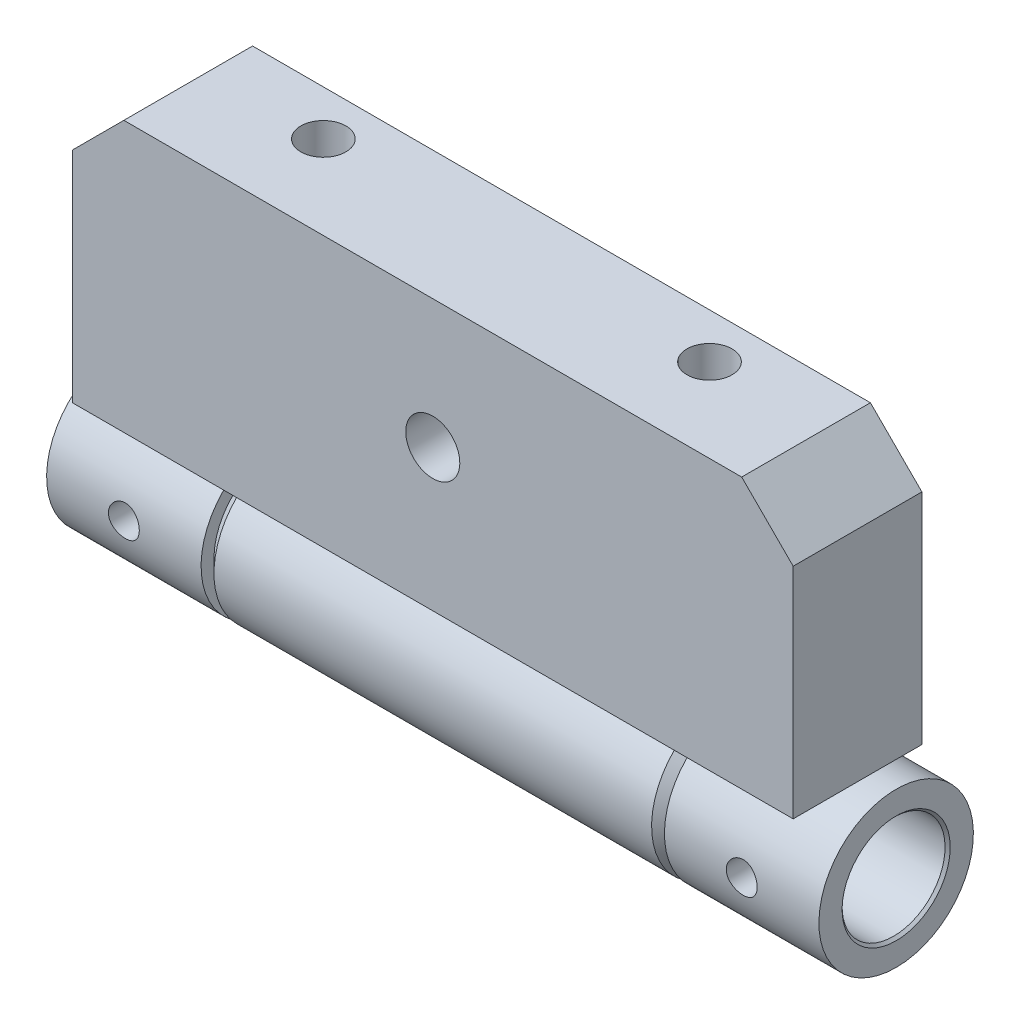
ISO-10303-21;
HEADER;
FILE_DESCRIPTION(('STEP AP214'),'2;1');
FILE_NAME('part.step','',(''),(''),'','','');
FILE_SCHEMA(('AUTOMOTIVE_DESIGN { 1 0 10303 214 1 1 1 1 }'));
ENDSEC;
DATA;
#1=APPLICATION_CONTEXT('core data for automotive mechanical design processes');
#2=APPLICATION_PROTOCOL_DEFINITION('international standard','automotive_design',2000,#1);
#3=PRODUCT_CONTEXT('',#1,'mechanical');
#4=PRODUCT('Part','Part','',(#3));
#5=PRODUCT_RELATED_PRODUCT_CATEGORY('part','',(#4));
#6=PRODUCT_DEFINITION_FORMATION('','',#4);
#7=PRODUCT_DEFINITION_CONTEXT('part definition',#1,'design');
#8=PRODUCT_DEFINITION('design','',#6,#7);
#9=PRODUCT_DEFINITION_SHAPE('','',#8);
#10=(LENGTH_UNIT() NAMED_UNIT(*) SI_UNIT(.MILLI.,.METRE.));
#11=(NAMED_UNIT(*) PLANE_ANGLE_UNIT() SI_UNIT($,.RADIAN.));
#12=(NAMED_UNIT(*) SI_UNIT($,.STERADIAN.) SOLID_ANGLE_UNIT());
#13=UNCERTAINTY_MEASURE_WITH_UNIT(LENGTH_MEASURE(1.E-05),#10,'distance_accuracy_value','');
#14=(GEOMETRIC_REPRESENTATION_CONTEXT(3) GLOBAL_UNCERTAINTY_ASSIGNED_CONTEXT((#13)) GLOBAL_UNIT_ASSIGNED_CONTEXT((#10,
#11,#12)) REPRESENTATION_CONTEXT('',''));
#15=CARTESIAN_POINT('',(0.,0.,0.));
#16=DIRECTION('',(0.,0.,1.));
#17=DIRECTION('',(1.,0.,0.));
#18=AXIS2_PLACEMENT_3D('',#15,#16,#17);
#19=CARTESIAN_POINT('',(140.,135.,30.));
#20=DIRECTION('',(0.,0.,-1.));
#21=DIRECTION('',(0.,1.,0.));
#22=AXIS2_PLACEMENT_3D('',#19,#20,#21);
#23=PLANE('',#22);
#24=CARTESIAN_POINT('',(0.,85.,30.));
#25=DIRECTION('',(0.,0.,-1.));
#26=DIRECTION('',(0.,1.,0.));
#27=AXIS2_PLACEMENT_3D('',#24,#25,#26);
#28=CIRCLE('',#27,10.5);
#29=CARTESIAN_POINT('',(0.,95.5,30.));
#30=VERTEX_POINT('',#29);
#31=EDGE_CURVE('E133',#30,#30,#28,.T.);
#32=ORIENTED_EDGE('',*,*,#31,.T.);
#33=EDGE_LOOP('',(#32));
#34=FACE_BOUND('',#33,.T.);
#35=DIRECTION('',(0.,-1.,0.));
#36=VECTOR('',#35,1.);
#37=CARTESIAN_POINT('',(140.,135.,30.));
#38=LINE('',#37,#36);
#39=CARTESIAN_POINT('',(140.,115.,30.));
#40=VERTEX_POINT('',#39);
#41=CARTESIAN_POINT('',(140.,30.,30.));
#42=VERTEX_POINT('',#41);
#43=EDGE_CURVE('E143',#40,#42,#38,.T.);
#44=ORIENTED_EDGE('',*,*,#43,.F.);
#45=DIRECTION('',(-0.70710678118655,0.707106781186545,0.));
#46=VECTOR('',#45,1.);
#47=CARTESIAN_POINT('',(140.,115.,30.));
#48=LINE('',#47,#46);
#49=CARTESIAN_POINT('',(120.,135.,30.));
#50=VERTEX_POINT('',#49);
#51=EDGE_CURVE('E171',#40,#50,#48,.T.);
#52=ORIENTED_EDGE('',*,*,#51,.T.);
#53=DIRECTION('',(-1.,0.,0.));
#54=VECTOR('',#53,1.);
#55=CARTESIAN_POINT('',(140.,135.,30.));
#56=LINE('',#55,#54);
#57=CARTESIAN_POINT('',(-120.,135.,30.));
#58=VERTEX_POINT('',#57);
#59=EDGE_CURVE('E151',#50,#58,#56,.T.);
#60=ORIENTED_EDGE('',*,*,#59,.T.);
#61=DIRECTION('',(0.707106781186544,0.707106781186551,0.));
#62=VECTOR('',#61,1.);
#63=CARTESIAN_POINT('',(-120.,135.,30.));
#64=LINE('',#63,#62);
#65=CARTESIAN_POINT('',(-140.,115.,30.));
#66=VERTEX_POINT('',#65);
#67=EDGE_CURVE('E169',#58,#66,#64,.F.);
#68=ORIENTED_EDGE('',*,*,#67,.T.);
#69=DIRECTION('',(0.,-1.,0.));
#70=VECTOR('',#69,1.);
#71=CARTESIAN_POINT('',(-140.,135.,30.));
#72=LINE('',#71,#70);
#73=CARTESIAN_POINT('',(-140.,30.,30.));
#74=VERTEX_POINT('',#73);
#75=EDGE_CURVE('E140',#66,#74,#72,.T.);
#76=ORIENTED_EDGE('',*,*,#75,.T.);
#77=DIRECTION('',(-1.,0.,0.));
#78=VECTOR('',#77,1.);
#79=CARTESIAN_POINT('',(140.,30.,30.));
#80=LINE('',#79,#78);
#81=EDGE_CURVE('E163',#42,#74,#80,.T.);
#82=ORIENTED_EDGE('',*,*,#81,.F.);
#83=EDGE_LOOP('',(#44,#52,#60,#68,#76,#82));
#84=FACE_BOUND('',#83,.T.);
#85=ADVANCED_FACE('F51',(#34,#84),#23,.F.);
#86=CARTESIAN_POINT('',(140.,30.,30.));
#87=DIRECTION('',(0.,1.,0.));
#88=DIRECTION('',(0.,0.,1.));
#89=AXIS2_PLACEMENT_3D('',#86,#87,#88);
#90=PLANE('',#89);
#91=DIRECTION('',(0.,0.,-1.));
#92=VECTOR('',#91,1.);
#93=CARTESIAN_POINT('',(-140.,30.,30.));
#94=LINE('',#93,#92);
#95=CARTESIAN_POINT('',(-140.,30.,-20.));
#96=VERTEX_POINT('',#95);
#97=EDGE_CURVE('E153',#74,#96,#94,.T.);
#98=ORIENTED_EDGE('',*,*,#97,.T.);
#99=DIRECTION('',(-1.,0.,0.));
#100=VECTOR('',#99,1.);
#101=CARTESIAN_POINT('',(140.,30.,-20.));
#102=LINE('',#101,#100);
#103=CARTESIAN_POINT('',(140.,30.,-20.));
#104=VERTEX_POINT('',#103);
#105=EDGE_CURVE('E160',#104,#96,#102,.T.);
#106=ORIENTED_EDGE('',*,*,#105,.F.);
#107=DIRECTION('',(0.,0.,-1.));
#108=VECTOR('',#107,1.);
#109=CARTESIAN_POINT('',(140.,30.,30.));
#110=LINE('',#109,#108);
#111=EDGE_CURVE('E145',#42,#104,#110,.T.);
#112=ORIENTED_EDGE('',*,*,#111,.F.);
#113=ORIENTED_EDGE('',*,*,#81,.T.);
#114=EDGE_LOOP('',(#98,#106,#112,#113));
#115=FACE_BOUND('',#114,.T.);
#116=ADVANCED_FACE('F200',(#115),#90,.F.);
#117=CARTESIAN_POINT('',(140.,135.,-20.));
#118=DIRECTION('',(0.,0.,1.));
#119=DIRECTION('',(0.,-1.,0.));
#120=AXIS2_PLACEMENT_3D('',#117,#118,#119);
#121=PLANE('',#120);
#122=CARTESIAN_POINT('',(0.,85.,-20.));
#123=DIRECTION('',(0.,0.,-1.));
#124=DIRECTION('',(0.,1.,0.));
#125=AXIS2_PLACEMENT_3D('',#122,#123,#124);
#126=CIRCLE('',#125,25.);
#127=CARTESIAN_POINT('',(0.,110.,-20.));
#128=VERTEX_POINT('',#127);
#129=EDGE_CURVE('E136',#128,#128,#126,.T.);
#130=ORIENTED_EDGE('',*,*,#129,.F.);
#131=EDGE_LOOP('',(#130));
#132=FACE_BOUND('',#131,.T.);
#133=DIRECTION('',(-1.,0.,0.));
#134=VECTOR('',#133,1.);
#135=CARTESIAN_POINT('',(140.,135.,-20.));
#136=LINE('',#135,#134);
#137=CARTESIAN_POINT('',(120.,135.,-20.));
#138=VERTEX_POINT('',#137);
#139=CARTESIAN_POINT('',(-120.,135.,-20.));
#140=VERTEX_POINT('',#139);
#141=EDGE_CURVE('E158',#138,#140,#136,.T.);
#142=ORIENTED_EDGE('',*,*,#141,.F.);
#143=DIRECTION('',(0.70710678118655,-0.707106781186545,0.));
#144=VECTOR('',#143,1.);
#145=CARTESIAN_POINT('',(140.,115.,-20.));
#146=LINE('',#145,#144);
#147=CARTESIAN_POINT('',(140.,115.,-20.));
#148=VERTEX_POINT('',#147);
#149=EDGE_CURVE('E59',#138,#148,#146,.T.);
#150=ORIENTED_EDGE('',*,*,#149,.T.);
#151=DIRECTION('',(0.,1.,0.));
#152=VECTOR('',#151,1.);
#153=CARTESIAN_POINT('',(140.,135.,-20.));
#154=LINE('',#153,#152);
#155=EDGE_CURVE('E148',#104,#148,#154,.T.);
#156=ORIENTED_EDGE('',*,*,#155,.F.);
#157=ORIENTED_EDGE('',*,*,#105,.T.);
#158=DIRECTION('',(0.,1.,0.));
#159=VECTOR('',#158,1.);
#160=CARTESIAN_POINT('',(-140.,135.,-20.));
#161=LINE('',#160,#159);
#162=CARTESIAN_POINT('',(-140.,115.,-20.));
#163=VERTEX_POINT('',#162);
#164=EDGE_CURVE('E146',#96,#163,#161,.T.);
#165=ORIENTED_EDGE('',*,*,#164,.T.);
#166=DIRECTION('',(-0.707106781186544,-0.707106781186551,0.));
#167=VECTOR('',#166,1.);
#168=CARTESIAN_POINT('',(-120.,135.,-20.));
#169=LINE('',#168,#167);
#170=EDGE_CURVE('E71',#163,#140,#169,.F.);
#171=ORIENTED_EDGE('',*,*,#170,.T.);
#172=EDGE_LOOP('',(#142,#150,#156,#157,#165,#171));
#173=FACE_BOUND('',#172,.T.);
#174=ADVANCED_FACE('F180',(#132,#173),#121,.F.);
#175=CARTESIAN_POINT('',(140.,135.,30.));
#176=DIRECTION('',(0.,-1.,0.));
#177=DIRECTION('',(0.,0.,-1.));
#178=AXIS2_PLACEMENT_3D('',#175,#176,#177);
#179=PLANE('',#178);
#180=CARTESIAN_POINT('',(-75.,135.,-2.49999999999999));
#181=DIRECTION('',(0.,1.,0.));
#182=DIRECTION('',(0.,0.,1.));
#183=AXIS2_PLACEMENT_3D('',#180,#181,#182);
#184=CIRCLE('',#183,8.74999999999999);
#185=CARTESIAN_POINT('',(-75.,135.,6.25000000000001));
#186=VERTEX_POINT('',#185);
#187=EDGE_CURVE('E120',#186,#186,#184,.T.);
#188=ORIENTED_EDGE('',*,*,#187,.F.);
#189=EDGE_LOOP('',(#188));
#190=FACE_BOUND('',#189,.T.);
#191=CARTESIAN_POINT('',(75.,135.,-2.50000000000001));
#192=DIRECTION('',(0.,1.,0.));
#193=DIRECTION('',(0.,0.,1.));
#194=AXIS2_PLACEMENT_3D('',#191,#192,#193);
#195=CIRCLE('',#194,8.74999999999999);
#196=CARTESIAN_POINT('',(75.,135.,6.24999999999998));
#197=VERTEX_POINT('',#196);
#198=EDGE_CURVE('E119',#197,#197,#195,.T.);
#199=ORIENTED_EDGE('',*,*,#198,.F.);
#200=EDGE_LOOP('',(#199));
#201=FACE_BOUND('',#200,.T.);
#202=ORIENTED_EDGE('',*,*,#59,.F.);
#203=DIRECTION('',(0.,0.,-1.));
#204=VECTOR('',#203,1.);
#205=CARTESIAN_POINT('',(120.,135.,-20.));
#206=LINE('',#205,#204);
#207=EDGE_CURVE('E176',#50,#138,#206,.T.);
#208=ORIENTED_EDGE('',*,*,#207,.T.);
#209=ORIENTED_EDGE('',*,*,#141,.T.);
#210=DIRECTION('',(0.,0.,1.));
#211=VECTOR('',#210,1.);
#212=CARTESIAN_POINT('',(-120.,135.,30.));
#213=LINE('',#212,#211);
#214=EDGE_CURVE('E173',#140,#58,#213,.T.);
#215=ORIENTED_EDGE('',*,*,#214,.T.);
#216=EDGE_LOOP('',(#202,#208,#209,#215));
#217=FACE_BOUND('',#216,.T.);
#218=ADVANCED_FACE('F194',(#190,#201,#217),#179,.F.);
#219=CARTESIAN_POINT('',(140.,30.,30.));
#220=DIRECTION('',(1.,0.,0.));
#221=DIRECTION('',(0.,0.,-1.));
#222=AXIS2_PLACEMENT_3D('',#219,#220,#221);
#223=PLANE('',#222);
#224=ORIENTED_EDGE('',*,*,#155,.T.);
#225=DIRECTION('',(0.,0.,1.));
#226=VECTOR('',#225,1.);
#227=CARTESIAN_POINT('',(140.,115.,30.));
#228=LINE('',#227,#226);
#229=EDGE_CURVE('E166',#148,#40,#228,.T.);
#230=ORIENTED_EDGE('',*,*,#229,.T.);
#231=ORIENTED_EDGE('',*,*,#43,.T.);
#232=ORIENTED_EDGE('',*,*,#111,.T.);
#233=EDGE_LOOP('',(#224,#230,#231,#232));
#234=FACE_BOUND('',#233,.T.);
#235=ADVANCED_FACE('F185',(#234),#223,.T.);
#236=CARTESIAN_POINT('',(-140.,30.,30.));
#237=DIRECTION('',(1.,0.,0.));
#238=DIRECTION('',(0.,0.,-1.));
#239=AXIS2_PLACEMENT_3D('',#236,#237,#238);
#240=PLANE('',#239);
#241=ORIENTED_EDGE('',*,*,#75,.F.);
#242=DIRECTION('',(0.,0.,-1.));
#243=VECTOR('',#242,1.);
#244=CARTESIAN_POINT('',(-140.,115.,30.));
#245=LINE('',#244,#243);
#246=EDGE_CURVE('E12',#66,#163,#245,.T.);
#247=ORIENTED_EDGE('',*,*,#246,.T.);
#248=ORIENTED_EDGE('',*,*,#164,.F.);
#249=ORIENTED_EDGE('',*,*,#97,.F.);
#250=EDGE_LOOP('',(#241,#247,#248,#249));
#251=FACE_BOUND('',#250,.T.);
#252=ADVANCED_FACE('F198',(#251),#240,.F.);
#253=CARTESIAN_POINT('',(0.,85.,0.));
#254=DIRECTION('',(0.,0.,-1.));
#255=DIRECTION('',(0.,1.,0.));
#256=AXIS2_PLACEMENT_3D('',#253,#254,#255);
#257=CYLINDRICAL_SURFACE('',#256,25.);
#258=CARTESIAN_POINT('',(0.,85.,0.));
#259=DIRECTION('',(0.,0.,-1.));
#260=DIRECTION('',(0.,1.,0.));
#261=AXIS2_PLACEMENT_3D('',#258,#259,#260);
#262=CIRCLE('',#261,25.);
#263=CARTESIAN_POINT('',(0.,110.,0.));
#264=VERTEX_POINT('',#263);
#265=EDGE_CURVE('E137',#264,#264,#262,.T.);
#266=ORIENTED_EDGE('',*,*,#265,.F.);
#267=EDGE_LOOP('',(#266));
#268=FACE_BOUND('',#267,.T.);
#269=ORIENTED_EDGE('',*,*,#129,.T.);
#270=EDGE_LOOP('',(#269));
#271=FACE_BOUND('',#270,.T.);
#272=ADVANCED_FACE('F236',(#268,#271),#257,.F.);
#273=CARTESIAN_POINT('',(0.,85.,0.));
#274=DIRECTION('',(0.,0.,-1.));
#275=DIRECTION('',(0.,1.,0.));
#276=AXIS2_PLACEMENT_3D('',#273,#274,#275);
#277=PLANE('',#276);
#278=CARTESIAN_POINT('',(0.,85.,0.));
#279=DIRECTION('',(0.,0.,-1.));
#280=DIRECTION('',(0.,1.,0.));
#281=AXIS2_PLACEMENT_3D('',#278,#279,#280);
#282=CIRCLE('',#281,10.5);
#283=CARTESIAN_POINT('',(0.,95.5,0.));
#284=VERTEX_POINT('',#283);
#285=EDGE_CURVE('E130',#284,#284,#282,.T.);
#286=ORIENTED_EDGE('',*,*,#285,.F.);
#287=EDGE_LOOP('',(#286));
#288=FACE_BOUND('',#287,.T.);
#289=ORIENTED_EDGE('',*,*,#265,.T.);
#290=EDGE_LOOP('',(#289));
#291=FACE_BOUND('',#290,.T.);
#292=ADVANCED_FACE('F232',(#288,#291),#277,.T.);
#293=CARTESIAN_POINT('',(0.,85.,0.));
#294=DIRECTION('',(0.,0.,-1.));
#295=DIRECTION('',(0.,1.,0.));
#296=AXIS2_PLACEMENT_3D('',#293,#294,#295);
#297=CYLINDRICAL_SURFACE('',#296,10.5);
#298=ORIENTED_EDGE('',*,*,#285,.T.);
#299=EDGE_LOOP('',(#298));
#300=FACE_BOUND('',#299,.T.);
#301=ORIENTED_EDGE('',*,*,#31,.F.);
#302=EDGE_LOOP('',(#301));
#303=FACE_BOUND('',#302,.T.);
#304=ADVANCED_FACE('F228',(#300,#303),#297,.F.);
#305=CARTESIAN_POINT('',(75.,82.5,-2.50000000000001));
#306=DIRECTION('',(0.,1.,0.));
#307=DIRECTION('',(0.,0.,1.));
#308=AXIS2_PLACEMENT_3D('',#305,#306,#307);
#309=CONICAL_SURFACE('',#308,8.74999999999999,1.02974425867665);
#310=CARTESIAN_POINT('',(75.,77.2424695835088,-2.50000000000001));
#311=VERTEX_POINT('',#310);
#312=VERTEX_LOOP('',#311);
#313=FACE_BOUND('',#312,.T.);
#314=CARTESIAN_POINT('',(75.,82.5,-2.50000000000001));
#315=DIRECTION('',(0.,1.,0.));
#316=DIRECTION('',(0.,0.,1.));
#317=AXIS2_PLACEMENT_3D('',#314,#315,#316);
#318=CIRCLE('',#317,8.74999999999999);
#319=CARTESIAN_POINT('',(75.,82.5,6.24999999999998));
#320=VERTEX_POINT('',#319);
#321=EDGE_CURVE('E123',#320,#320,#318,.T.);
#322=ORIENTED_EDGE('',*,*,#321,.T.);
#323=EDGE_LOOP('',(#322));
#324=FACE_BOUND('',#323,.T.);
#325=ADVANCED_FACE('F224',(#313,#324),#309,.F.);
#326=CARTESIAN_POINT('',(75.,135.,-2.50000000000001));
#327=DIRECTION('',(0.,1.,0.));
#328=DIRECTION('',(0.,0.,1.));
#329=AXIS2_PLACEMENT_3D('',#326,#327,#328);
#330=CYLINDRICAL_SURFACE('',#329,8.74999999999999);
#331=ORIENTED_EDGE('',*,*,#321,.F.);
#332=EDGE_LOOP('',(#331));
#333=FACE_BOUND('',#332,.T.);
#334=ORIENTED_EDGE('',*,*,#198,.T.);
#335=EDGE_LOOP('',(#334));
#336=FACE_BOUND('',#335,.T.);
#337=ADVANCED_FACE('F113',(#333,#336),#330,.F.);
#338=CARTESIAN_POINT('',(-75.,82.5,-2.49999999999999));
#339=DIRECTION('',(0.,1.,0.));
#340=DIRECTION('',(0.,0.,1.));
#341=AXIS2_PLACEMENT_3D('',#338,#339,#340);
#342=CONICAL_SURFACE('',#341,8.74999999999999,1.02974425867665);
#343=CARTESIAN_POINT('',(-75.,77.2424695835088,-2.49999999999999));
#344=VERTEX_POINT('',#343);
#345=VERTEX_LOOP('',#344);
#346=FACE_BOUND('',#345,.T.);
#347=CARTESIAN_POINT('',(-75.,82.5,-2.49999999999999));
#348=DIRECTION('',(0.,1.,0.));
#349=DIRECTION('',(0.,0.,1.));
#350=AXIS2_PLACEMENT_3D('',#347,#348,#349);
#351=CIRCLE('',#350,8.74999999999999);
#352=CARTESIAN_POINT('',(-75.,82.5,6.25000000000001));
#353=VERTEX_POINT('',#352);
#354=EDGE_CURVE('E117',#353,#353,#351,.T.);
#355=ORIENTED_EDGE('',*,*,#354,.T.);
#356=EDGE_LOOP('',(#355));
#357=FACE_BOUND('',#356,.T.);
#358=ADVANCED_FACE('F109',(#346,#357),#342,.F.);
#359=CARTESIAN_POINT('',(-75.,135.,-2.49999999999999));
#360=DIRECTION('',(0.,1.,0.));
#361=DIRECTION('',(0.,0.,1.));
#362=AXIS2_PLACEMENT_3D('',#359,#360,#361);
#363=CYLINDRICAL_SURFACE('',#362,8.74999999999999);
#364=ORIENTED_EDGE('',*,*,#354,.F.);
#365=EDGE_LOOP('',(#364));
#366=FACE_BOUND('',#365,.T.);
#367=ORIENTED_EDGE('',*,*,#187,.T.);
#368=EDGE_LOOP('',(#367));
#369=FACE_BOUND('',#368,.T.);
#370=ADVANCED_FACE('F112',(#366,#369),#363,.F.);
#371=CARTESIAN_POINT('',(140.,115.,30.));
#372=DIRECTION('',(0.707106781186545,0.70710678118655,0.));
#373=DIRECTION('',(-0.70710678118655,0.707106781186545,0.));
#374=AXIS2_PLACEMENT_3D('',#371,#372,#373);
#375=PLANE('',#374);
#376=ORIENTED_EDGE('',*,*,#149,.F.);
#377=ORIENTED_EDGE('',*,*,#207,.F.);
#378=ORIENTED_EDGE('',*,*,#51,.F.);
#379=ORIENTED_EDGE('',*,*,#229,.F.);
#380=EDGE_LOOP('',(#376,#377,#378,#379));
#381=FACE_BOUND('',#380,.T.);
#382=ADVANCED_FACE('F189',(#381),#375,.T.);
#383=CARTESIAN_POINT('',(-120.,135.,30.));
#384=DIRECTION('',(0.707106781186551,-0.707106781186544,0.));
#385=DIRECTION('',(0.707106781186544,0.707106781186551,0.));
#386=AXIS2_PLACEMENT_3D('',#383,#384,#385);
#387=PLANE('',#386);
#388=ORIENTED_EDGE('',*,*,#170,.F.);
#389=ORIENTED_EDGE('',*,*,#246,.F.);
#390=ORIENTED_EDGE('',*,*,#67,.F.);
#391=ORIENTED_EDGE('',*,*,#214,.F.);
#392=EDGE_LOOP('',(#388,#389,#390,#391));
#393=FACE_BOUND('',#392,.T.);
#394=ADVANCED_FACE('F53',(#393),#387,.F.);
#395=CLOSED_SHELL('',(#85,#116,#174,#218,#235,#252,#272,#292,#304,#325,#337,#358,#370,#382,#394));
#396=MANIFOLD_SOLID_BREP('B2',#395);
#397=CARTESIAN_POINT('',(150.,0.,0.));
#398=DIRECTION('',(1.,0.,0.));
#399=DIRECTION('',(0.,-1.,0.));
#400=AXIS2_PLACEMENT_3D('',#397,#398,#399);
#401=PLANE('',#400);
#402=CARTESIAN_POINT('',(150.,0.,0.));
#403=DIRECTION('',(-1.,0.,0.));
#404=DIRECTION('',(0.,-1.,0.));
#405=AXIS2_PLACEMENT_3D('',#402,#403,#404);
#406=CIRCLE('',#405,21.);
#407=CARTESIAN_POINT('',(150.,-21.,0.));
#408=VERTEX_POINT('',#407);
#409=EDGE_CURVE('E367',#408,#408,#406,.F.);
#410=ORIENTED_EDGE('',*,*,#409,.F.);
#411=EDGE_LOOP('',(#410));
#412=FACE_BOUND('',#411,.T.);
#413=CARTESIAN_POINT('',(150.,0.,0.));
#414=DIRECTION('',(-1.,0.,0.));
#415=DIRECTION('',(0.,-1.,0.));
#416=AXIS2_PLACEMENT_3D('',#413,#414,#415);
#417=CIRCLE('',#416,30.);
#418=CARTESIAN_POINT('',(150.,-30.,0.));
#419=VERTEX_POINT('',#418);
#420=EDGE_CURVE('E376',#419,#419,#417,.T.);
#421=ORIENTED_EDGE('',*,*,#420,.F.);
#422=EDGE_LOOP('',(#421));
#423=FACE_BOUND('',#422,.T.);
#424=ADVANCED_FACE('F357',(#412,#423),#401,.T.);
#425=CARTESIAN_POINT('',(90.,0.,0.));
#426=DIRECTION('',(1.,0.,0.));
#427=DIRECTION('',(0.,-1.,0.));
#428=AXIS2_PLACEMENT_3D('',#425,#426,#427);
#429=PLANE('',#428);
#430=CARTESIAN_POINT('',(90.,0.,0.));
#431=DIRECTION('',(-1.,0.,0.));
#432=DIRECTION('',(0.,-1.,0.));
#433=AXIS2_PLACEMENT_3D('',#430,#431,#432);
#434=CIRCLE('',#433,30.);
#435=CARTESIAN_POINT('',(90.,-30.,0.));
#436=VERTEX_POINT('',#435);
#437=EDGE_CURVE('E412',#436,#436,#434,.T.);
#438=ORIENTED_EDGE('',*,*,#437,.T.);
#439=EDGE_LOOP('',(#438));
#440=FACE_BOUND('',#439,.T.);
#441=CARTESIAN_POINT('',(90.,0.,0.));
#442=DIRECTION('',(-1.,0.,0.));
#443=DIRECTION('',(0.,-1.,0.));
#444=AXIS2_PLACEMENT_3D('',#441,#442,#443);
#445=CIRCLE('',#444,20.);
#446=CARTESIAN_POINT('',(90.,-20.,0.));
#447=VERTEX_POINT('',#446);
#448=EDGE_CURVE('E409',#447,#447,#445,.T.);
#449=ORIENTED_EDGE('',*,*,#448,.F.);
#450=EDGE_LOOP('',(#449));
#451=FACE_BOUND('',#450,.T.);
#452=ADVANCED_FACE('F417',(#440,#451),#429,.F.);
#453=CARTESIAN_POINT('',(150.,0.,0.));
#454=DIRECTION('',(-1.,0.,0.));
#455=DIRECTION('',(0.,1.,0.));
#456=AXIS2_PLACEMENT_3D('',#453,#454,#455);
#457=CYLINDRICAL_SURFACE('',#456,30.);
#458=CARTESIAN_POINT('',(126.,0.,30.));
#459=CARTESIAN_POINT('',(126.000003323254,-0.166786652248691,30.0000016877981));
#460=CARTESIAN_POINT('',(125.993043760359,-0.33353168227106,29.9986067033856));
#461=CARTESIAN_POINT('',(125.96526720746,-0.665867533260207,29.9930693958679));
#462=CARTESIAN_POINT('',(125.944447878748,-0.831458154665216,29.9889266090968));
#463=CARTESIAN_POINT('',(125.88909772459,-1.16032458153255,29.9780042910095));
#464=CARTESIAN_POINT('',(125.854559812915,-1.32359914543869,29.9712233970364));
#465=CARTESIAN_POINT('',(125.772030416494,-1.64665330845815,29.9552115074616));
#466=CARTESIAN_POINT('',(125.724033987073,-1.80643159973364,29.9459796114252));
#467=CARTESIAN_POINT('',(125.615035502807,-2.12109983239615,29.9253365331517));
#468=CARTESIAN_POINT('',(125.554050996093,-2.27599604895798,29.9139282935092));
#469=CARTESIAN_POINT('',(125.41946882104,-2.58011997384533,29.8892333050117));
#470=CARTESIAN_POINT('',(125.345866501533,-2.72934556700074,29.8759458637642));
#471=CARTESIAN_POINT('',(125.18663348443,-3.02099738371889,29.847864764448));
#472=CARTESIAN_POINT('',(125.101008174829,-3.16342661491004,29.8330717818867));
#473=CARTESIAN_POINT('',(124.918272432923,-3.44066424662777,29.8023705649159));
#474=CARTESIAN_POINT('',(124.821157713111,-3.57546977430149,29.7864619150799));
#475=CARTESIAN_POINT('',(124.614925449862,-3.83805424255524,29.7537737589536));
#476=CARTESIAN_POINT('',(124.505680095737,-3.96573181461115,29.736986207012));
#477=CARTESIAN_POINT('',(124.27684513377,-4.21150797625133,29.7031748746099));
#478=CARTESIAN_POINT('',(124.15725170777,-4.32960299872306,29.6861510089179));
#479=CARTESIAN_POINT('',(123.908598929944,-4.5553310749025,29.6523520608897));
#480=CARTESIAN_POINT('',(123.77954231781,-4.66296713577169,29.635576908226));
#481=CARTESIAN_POINT('',(123.512750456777,-4.86711503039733,29.6027344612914));
#482=CARTESIAN_POINT('',(123.375012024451,-4.96362274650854,29.5866674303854));
#483=CARTESIAN_POINT('',(123.090584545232,-5.14558410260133,29.555567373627));
#484=CARTESIAN_POINT('',(122.943827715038,-5.23093360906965,29.5405446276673));
#485=CARTESIAN_POINT('',(122.64343216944,-5.3889782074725,29.5121223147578));
#486=CARTESIAN_POINT('',(122.489790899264,-5.46166855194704,29.4987233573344));
#487=CARTESIAN_POINT('',(122.176811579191,-5.59377451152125,29.4739582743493));
#488=CARTESIAN_POINT('',(122.017476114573,-5.65319606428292,29.4625912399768));
#489=CARTESIAN_POINT('',(121.694188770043,-5.75835702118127,29.4422171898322));
#490=CARTESIAN_POINT('',(121.530235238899,-5.80409146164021,29.4332110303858));
#491=CARTESIAN_POINT('',(121.037685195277,-5.91908595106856,29.4103859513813));
#492=CARTESIAN_POINT('',(120.703895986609,-5.96802935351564,29.4003929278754));
#493=CARTESIAN_POINT('',(120.032889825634,-6.00933039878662,29.391977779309));
#494=CARTESIAN_POINT('',(119.695673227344,-6.00169382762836,29.3935544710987));
#495=CARTESIAN_POINT('',(119.032532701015,-5.93072281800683,29.4079543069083));
#496=CARTESIAN_POINT('',(118.706515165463,-5.86823000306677,29.4206075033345));
#497=CARTESIAN_POINT('',(118.069699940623,-5.69062854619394,29.4554724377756));
#498=CARTESIAN_POINT('',(117.758902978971,-5.57551739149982,29.4776846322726));
#499=CARTESIAN_POINT('',(117.158909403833,-5.29514836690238,29.5293371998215));
#500=CARTESIAN_POINT('',(116.869872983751,-5.12955681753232,29.5588254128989));
#501=CARTESIAN_POINT('',(116.323374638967,-4.75316153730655,29.6216771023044));
#502=CARTESIAN_POINT('',(116.065916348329,-4.54235261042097,29.6550410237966));
#503=CARTESIAN_POINT('',(115.585023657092,-4.0769995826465,29.7226212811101));
#504=CARTESIAN_POINT('',(115.362284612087,-3.82173696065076,29.7568421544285));
#505=CARTESIAN_POINT('',(114.962676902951,-3.2771101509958,29.8217309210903));
#506=CARTESIAN_POINT('',(114.785808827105,-2.98774552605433,29.8523987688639));
#507=CARTESIAN_POINT('',(114.482834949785,-2.38235631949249,29.9068014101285));
#508=CARTESIAN_POINT('',(114.356808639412,-2.06629091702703,29.9305253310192));
#509=CARTESIAN_POINT('',(114.15983715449,-1.41689385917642,29.9682845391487));
#510=CARTESIAN_POINT('',(114.088885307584,-1.08356430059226,29.9823210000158));
#511=CARTESIAN_POINT('',(114.005061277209,-0.415076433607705,29.9989603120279));
#512=CARTESIAN_POINT('',(113.991237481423,-0.0800419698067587,30.0017504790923));
#513=CARTESIAN_POINT('',(114.019499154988,0.587549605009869,29.996103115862));
#514=CARTESIAN_POINT('',(114.061581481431,0.920106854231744,29.987666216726));
#515=CARTESIAN_POINT('',(114.199670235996,1.57023396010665,29.960629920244));
#516=CARTESIAN_POINT('',(114.295188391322,1.88791169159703,29.9421225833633));
#517=CARTESIAN_POINT('',(114.536903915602,2.50274176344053,29.8970131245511));
#518=CARTESIAN_POINT('',(114.683105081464,2.79989256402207,29.8704103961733));
#519=CARTESIAN_POINT('',(115.024094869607,3.36924704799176,29.8115946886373));
#520=CARTESIAN_POINT('',(115.219456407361,3.64110078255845,29.7793170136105));
#521=CARTESIAN_POINT('',(115.652455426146,4.14850809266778,29.7128841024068));
#522=CARTESIAN_POINT('',(115.890097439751,4.38405777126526,29.6787286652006));
#523=CARTESIAN_POINT('',(116.405239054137,4.81584362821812,29.6117581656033));
#524=CARTESIAN_POINT('',(116.683290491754,5.011426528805,29.5789714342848));
#525=CARTESIAN_POINT('',(117.268872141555,5.35311220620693,29.5190516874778));
#526=CARTESIAN_POINT('',(117.57640117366,5.49921696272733,29.4919184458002));
#527=CARTESIAN_POINT('',(118.210594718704,5.73691221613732,29.4466037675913));
#528=CARTESIAN_POINT('',(118.537150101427,5.82878534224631,29.4283760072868));
#529=CARTESIAN_POINT('',(119.201655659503,5.95624756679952,29.4028486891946));
#530=CARTESIAN_POINT('',(119.539604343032,5.99184400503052,29.3955477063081));
#531=CARTESIAN_POINT('',(120.044004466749,6.00215206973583,29.393434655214));
#532=CARTESIAN_POINT('',(120.210271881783,5.9986202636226,29.3941596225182));
#533=CARTESIAN_POINT('',(120.54188855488,5.97778381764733,29.398405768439));
#534=CARTESIAN_POINT('',(120.707238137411,5.96048440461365,29.4019258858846));
#535=CARTESIAN_POINT('',(121.035898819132,5.91223531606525,29.4116654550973));
#536=CARTESIAN_POINT('',(121.199209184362,5.88128086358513,29.4178858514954));
#537=CARTESIAN_POINT('',(121.522535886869,5.80598159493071,29.4328396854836));
#538=CARTESIAN_POINT('',(121.682553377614,5.76164155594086,29.4415722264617));
#539=CARTESIAN_POINT('',(121.997907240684,5.66001374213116,29.4612782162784));
#540=CARTESIAN_POINT('',(122.153252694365,5.60275321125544,29.4722469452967));
#541=CARTESIAN_POINT('',(122.458502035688,5.4756816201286,29.4961198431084));
#542=CARTESIAN_POINT('',(122.608407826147,5.40587500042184,29.5090233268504));
#543=CARTESIAN_POINT('',(122.901897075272,5.25416908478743,29.5364122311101));
#544=CARTESIAN_POINT('',(123.045477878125,5.17226477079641,29.550898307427));
#545=CARTESIAN_POINT('',(123.325259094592,4.99698841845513,29.5810413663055));
#546=CARTESIAN_POINT('',(123.461462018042,4.90362031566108,29.5966979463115));
#547=CARTESIAN_POINT('',(123.727952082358,4.70431042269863,29.6290369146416));
#548=CARTESIAN_POINT('',(123.858095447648,4.59817846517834,29.6457323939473));
#549=CARTESIAN_POINT('',(124.108965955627,4.37544580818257,29.6794230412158));
#550=CARTESIAN_POINT('',(124.229696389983,4.25884879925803,29.696418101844));
#551=CARTESIAN_POINT('',(124.461048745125,4.01586865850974,29.7302514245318));
#552=CARTESIAN_POINT('',(124.571664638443,3.88947977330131,29.7470895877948));
#553=CARTESIAN_POINT('',(124.781912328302,3.62787334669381,29.7801260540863));
#554=CARTESIAN_POINT('',(124.881548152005,3.4926590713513,29.7963245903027));
#555=CARTESIAN_POINT('',(125.07020873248,3.21275204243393,29.8278103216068));
#556=CARTESIAN_POINT('',(125.159106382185,3.06797223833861,29.8430856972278));
#557=CARTESIAN_POINT('',(125.324333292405,2.77133359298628,29.8720925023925));
#558=CARTESIAN_POINT('',(125.400667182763,2.61947738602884,29.8858245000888));
#559=CARTESIAN_POINT('',(125.540189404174,2.30978799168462,29.9113522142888));
#560=CARTESIAN_POINT('',(125.603385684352,2.15195848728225,29.923149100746));
#561=CARTESIAN_POINT('',(125.716185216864,1.83142130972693,29.9444772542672));
#562=CARTESIAN_POINT('',(125.765791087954,1.66871458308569,29.9540089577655));
#563=CARTESIAN_POINT('',(125.871867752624,1.25904258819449,29.974570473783));
#564=CARTESIAN_POINT('',(125.919851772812,1.0097489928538,29.9840570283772));
#565=CARTESIAN_POINT('',(125.983914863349,0.506938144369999,29.9967704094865));
#566=CARTESIAN_POINT('',(125.99999495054,0.253421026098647,29.9999974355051));
#567=CARTESIAN_POINT('',(126.,0.,30.));
#568=B_SPLINE_CURVE_WITH_KNOTS('',3,(#458,#459,#460,#461,#462,#463,#464,#465,#466,#467,#468,
#469,#470,#471,#472,#473,#474,#475,#476,#477,#478,#479,#480,#481,#482,#483,#484,#485,#486,#487,
#488,#489,#490,#491,#492,#493,#494,#495,#496,#497,#498,#499,#500,#501,#502,#503,#504,#505,#506,
#507,#508,#509,#510,#511,#512,#513,#514,#515,#516,#517,#518,#519,#520,#521,#522,#523,#524,#525,
#526,#527,#528,#529,#530,#531,#532,#533,#534,#535,#536,#537,#538,#539,#540,#541,#542,#543,#544,
#545,#546,#547,#548,#549,#550,#551,#552,#553,#554,#555,#556,#557,#558,#559,#560,#561,#562,#563,
#564,#565,#566,#567),.UNSPECIFIED.,.T.,.F.,(4,2,2,2,2,2,2,2,2,2,2,2,2,2,2,2,2,2,2,2,2,2,2,2,2,2,
2,2,2,2,2,2,2,2,2,2,2,2,2,2,2,2,2,2,2,2,2,2,2,2,2,2,2,2,4),(0.,0.500137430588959,
1.00035927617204,1.50083984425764,2.00150453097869,2.5014970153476,3.00167420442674,
3.50162795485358,4.0017688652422,4.50779597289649,5.01401059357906,5.52007923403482,
6.02633453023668,6.53702041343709,7.04789740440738,7.55854532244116,8.06937820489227,
9.07654034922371,10.0835994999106,11.0754728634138,12.0673935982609,13.0660186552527,
14.0647585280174,15.0814643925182,16.0981832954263,17.1164857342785,18.1346647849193,
19.135813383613,20.1369057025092,21.1289964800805,22.1211615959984,23.1254732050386,
24.1298925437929,25.1496069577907,26.1692805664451,27.1835921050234,28.1977713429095,
28.696203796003,29.1944471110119,29.6928648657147,30.1911049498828,30.6883041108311,
31.1853276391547,31.6825579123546,32.1796179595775,32.6853083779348,33.1908211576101,
33.6966332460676,34.2022591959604,34.7133809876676,35.224314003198,35.7349369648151,
36.2454614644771,37.0054106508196,37.7653356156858),.UNSPECIFIED.);
#569=CARTESIAN_POINT('',(126.,0.,30.));
#570=VERTEX_POINT('',#569);
#571=EDGE_CURVE('E50',#570,#570,#568,.T.);
#572=ORIENTED_EDGE('',*,*,#571,.T.);
#573=EDGE_LOOP('',(#572));
#574=FACE_BOUND('',#573,.T.);
#575=CARTESIAN_POINT('',(126.,0.,-30.));
#576=CARTESIAN_POINT('',(126.000003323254,0.166786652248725,-30.0000016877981));
#577=CARTESIAN_POINT('',(125.993043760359,0.333531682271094,-29.9986067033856));
#578=CARTESIAN_POINT('',(125.96526720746,0.665867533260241,-29.9930693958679));
#579=CARTESIAN_POINT('',(125.944447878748,0.831458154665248,-29.9889266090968));
#580=CARTESIAN_POINT('',(125.88909772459,1.16032458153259,-29.9780042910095));
#581=CARTESIAN_POINT('',(125.854559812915,1.32359914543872,-29.9712233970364));
#582=CARTESIAN_POINT('',(125.772030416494,1.64665330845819,-29.9552115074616));
#583=CARTESIAN_POINT('',(125.724033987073,1.80643159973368,-29.9459796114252));
#584=CARTESIAN_POINT('',(125.615035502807,2.12109983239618,-29.9253365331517));
#585=CARTESIAN_POINT('',(125.554050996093,2.27599604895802,-29.9139282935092));
#586=CARTESIAN_POINT('',(125.41946882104,2.58011997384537,-29.8892333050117));
#587=CARTESIAN_POINT('',(125.345866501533,2.72934556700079,-29.8759458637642));
#588=CARTESIAN_POINT('',(125.186633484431,3.02099738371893,-29.847864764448));
#589=CARTESIAN_POINT('',(125.101008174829,3.16342661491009,-29.8330717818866));
#590=CARTESIAN_POINT('',(124.918272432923,3.44066424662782,-29.8023705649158));
#591=CARTESIAN_POINT('',(124.821157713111,3.57546977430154,-29.7864619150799));
#592=CARTESIAN_POINT('',(124.614925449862,3.83805424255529,-29.7537737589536));
#593=CARTESIAN_POINT('',(124.505680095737,3.96573181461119,-29.736986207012));
#594=CARTESIAN_POINT('',(124.27684513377,4.21150797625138,-29.7031748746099));
#595=CARTESIAN_POINT('',(124.15725170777,4.32960299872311,-29.6861510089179));
#596=CARTESIAN_POINT('',(123.908598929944,4.55533107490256,-29.6523520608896));
#597=CARTESIAN_POINT('',(123.77954231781,4.66296713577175,-29.6355769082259));
#598=CARTESIAN_POINT('',(123.512750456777,4.8671150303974,-29.6027344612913));
#599=CARTESIAN_POINT('',(123.375012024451,4.96362274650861,-29.5866674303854));
#600=CARTESIAN_POINT('',(123.090584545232,5.14558410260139,-29.555567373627));
#601=CARTESIAN_POINT('',(122.943827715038,5.23093360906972,-29.5405446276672));
#602=CARTESIAN_POINT('',(122.64343216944,5.38897820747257,-29.5121223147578));
#603=CARTESIAN_POINT('',(122.489790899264,5.46166855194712,-29.4987233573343));
#604=CARTESIAN_POINT('',(122.176811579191,5.59377451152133,-29.4739582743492));
#605=CARTESIAN_POINT('',(122.017476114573,5.653196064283,-29.4625912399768));
#606=CARTESIAN_POINT('',(121.694188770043,5.75835702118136,-29.4422171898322));
#607=CARTESIAN_POINT('',(121.530235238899,5.8040914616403,-29.4332110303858));
#608=CARTESIAN_POINT('',(121.037685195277,5.91908595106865,-29.4103859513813));
#609=CARTESIAN_POINT('',(120.703895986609,5.96802935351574,-29.4003929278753));
#610=CARTESIAN_POINT('',(120.032889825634,6.00933039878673,-29.391977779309));
#611=CARTESIAN_POINT('',(119.695673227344,6.00169382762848,-29.3935544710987));
#612=CARTESIAN_POINT('',(119.032532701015,5.93072281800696,-29.4079543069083));
#613=CARTESIAN_POINT('',(118.706515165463,5.8682300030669,-29.4206075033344));
#614=CARTESIAN_POINT('',(118.069699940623,5.69062854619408,-29.4554724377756));
#615=CARTESIAN_POINT('',(117.758902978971,5.57551739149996,-29.4776846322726));
#616=CARTESIAN_POINT('',(117.158909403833,5.29514836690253,-29.5293371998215));
#617=CARTESIAN_POINT('',(116.869872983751,5.12955681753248,-29.5588254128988));
#618=CARTESIAN_POINT('',(116.323374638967,4.75316153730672,-29.6216771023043));
#619=CARTESIAN_POINT('',(116.065916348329,4.54235261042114,-29.6550410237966));
#620=CARTESIAN_POINT('',(115.585023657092,4.07699958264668,-29.7226212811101));
#621=CARTESIAN_POINT('',(115.362284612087,3.82173696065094,-29.7568421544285));
#622=CARTESIAN_POINT('',(114.962676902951,3.27711015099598,-29.8217309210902));
#623=CARTESIAN_POINT('',(114.785808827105,2.98774552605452,-29.8523987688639));
#624=CARTESIAN_POINT('',(114.482834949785,2.38235631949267,-29.9068014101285));
#625=CARTESIAN_POINT('',(114.356808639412,2.06629091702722,-29.9305253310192));
#626=CARTESIAN_POINT('',(114.15983715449,1.41689385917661,-29.9682845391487));
#627=CARTESIAN_POINT('',(114.088885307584,1.08356430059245,-29.9823210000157));
#628=CARTESIAN_POINT('',(114.005061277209,0.415076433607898,-29.9989603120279));
#629=CARTESIAN_POINT('',(113.991237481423,0.080041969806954,-30.0017504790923));
#630=CARTESIAN_POINT('',(114.019499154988,-0.587549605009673,-29.996103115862));
#631=CARTESIAN_POINT('',(114.061581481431,-0.92010685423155,-29.987666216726));
#632=CARTESIAN_POINT('',(114.199670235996,-1.57023396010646,-29.960629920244));
#633=CARTESIAN_POINT('',(114.295188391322,-1.88791169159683,-29.9421225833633));
#634=CARTESIAN_POINT('',(114.536903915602,-2.50274176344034,-29.8970131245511));
#635=CARTESIAN_POINT('',(114.683105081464,-2.79989256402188,-29.8704103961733));
#636=CARTESIAN_POINT('',(115.024094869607,-3.36924704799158,-29.8115946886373));
#637=CARTESIAN_POINT('',(115.219456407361,-3.64110078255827,-29.7793170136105));
#638=CARTESIAN_POINT('',(115.652455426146,-4.1485080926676,-29.7128841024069));
#639=CARTESIAN_POINT('',(115.890097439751,-4.38405777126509,-29.6787286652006));
#640=CARTESIAN_POINT('',(116.405239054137,-4.81584362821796,-29.6117581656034));
#641=CARTESIAN_POINT('',(116.683290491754,-5.01142652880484,-29.5789714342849));
#642=CARTESIAN_POINT('',(117.268872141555,-5.35311220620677,-29.5190516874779));
#643=CARTESIAN_POINT('',(117.576401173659,-5.49921696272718,-29.4919184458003));
#644=CARTESIAN_POINT('',(118.210594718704,-5.73691221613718,-29.4466037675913));
#645=CARTESIAN_POINT('',(118.537150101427,-5.82878534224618,-29.4283760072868));
#646=CARTESIAN_POINT('',(119.201655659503,-5.9562475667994,-29.4028486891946));
#647=CARTESIAN_POINT('',(119.539604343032,-5.9918440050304,-29.3955477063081));
#648=CARTESIAN_POINT('',(120.044004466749,-6.00215206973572,-29.3934346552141));
#649=CARTESIAN_POINT('',(120.210271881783,-5.99862026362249,-29.3941596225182));
#650=CARTESIAN_POINT('',(120.54188855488,-5.97778381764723,-29.398405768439));
#651=CARTESIAN_POINT('',(120.70723813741,-5.96048440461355,-29.4019258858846));
#652=CARTESIAN_POINT('',(121.035898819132,-5.91223531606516,-29.4116654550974));
#653=CARTESIAN_POINT('',(121.199209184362,-5.88128086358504,-29.4178858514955));
#654=CARTESIAN_POINT('',(121.522535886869,-5.80598159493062,-29.4328396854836));
#655=CARTESIAN_POINT('',(121.682553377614,-5.76164155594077,-29.4415722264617));
#656=CARTESIAN_POINT('',(121.997907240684,-5.66001374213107,-29.4612782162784));
#657=CARTESIAN_POINT('',(122.153252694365,-5.60275321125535,-29.4722469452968));
#658=CARTESIAN_POINT('',(122.458502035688,-5.47568162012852,-29.4961198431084));
#659=CARTESIAN_POINT('',(122.608407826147,-5.40587500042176,-29.5090233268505));
#660=CARTESIAN_POINT('',(122.901897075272,-5.25416908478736,-29.5364122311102));
#661=CARTESIAN_POINT('',(123.045477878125,-5.17226477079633,-29.550898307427));
#662=CARTESIAN_POINT('',(123.325259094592,-4.99698841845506,-29.5810413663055));
#663=CARTESIAN_POINT('',(123.461462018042,-4.90362031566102,-29.5966979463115));
#664=CARTESIAN_POINT('',(123.727952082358,-4.70431042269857,-29.6290369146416));
#665=CARTESIAN_POINT('',(123.858095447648,-4.59817846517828,-29.6457323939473));
#666=CARTESIAN_POINT('',(124.108965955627,-4.37544580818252,-29.6794230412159));
#667=CARTESIAN_POINT('',(124.229696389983,-4.25884879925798,-29.696418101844));
#668=CARTESIAN_POINT('',(124.461048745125,-4.0158686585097,-29.7302514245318));
#669=CARTESIAN_POINT('',(124.571664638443,-3.88947977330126,-29.7470895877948));
#670=CARTESIAN_POINT('',(124.781912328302,-3.62787334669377,-29.7801260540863));
#671=CARTESIAN_POINT('',(124.881548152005,-3.49265907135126,-29.7963245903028));
#672=CARTESIAN_POINT('',(125.07020873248,-3.2127520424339,-29.8278103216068));
#673=CARTESIAN_POINT('',(125.159106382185,-3.06797223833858,-29.8430856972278));
#674=CARTESIAN_POINT('',(125.324333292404,-2.77133359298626,-29.8720925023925));
#675=CARTESIAN_POINT('',(125.400667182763,-2.61947738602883,-29.8858245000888));
#676=CARTESIAN_POINT('',(125.540189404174,-2.3097879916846,-29.9113522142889));
#677=CARTESIAN_POINT('',(125.603385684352,-2.15195848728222,-29.923149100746));
#678=CARTESIAN_POINT('',(125.716185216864,-1.8314213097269,-29.9444772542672));
#679=CARTESIAN_POINT('',(125.765791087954,-1.66871458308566,-29.9540089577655));
#680=CARTESIAN_POINT('',(125.871867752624,-1.25904258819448,-29.974570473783));
#681=CARTESIAN_POINT('',(125.919851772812,-1.00974899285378,-29.9840570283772));
#682=CARTESIAN_POINT('',(125.983914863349,-0.506938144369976,-29.9967704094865));
#683=CARTESIAN_POINT('',(125.99999495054,-0.25342102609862,-29.9999974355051));
#684=CARTESIAN_POINT('',(126.,0.,-30.));
#685=B_SPLINE_CURVE_WITH_KNOTS('',3,(#575,#576,#577,#578,#579,#580,#581,#582,#583,#584,#585,
#586,#587,#588,#589,#590,#591,#592,#593,#594,#595,#596,#597,#598,#599,#600,#601,#602,#603,#604,
#605,#606,#607,#608,#609,#610,#611,#612,#613,#614,#615,#616,#617,#618,#619,#620,#621,#622,#623,
#624,#625,#626,#627,#628,#629,#630,#631,#632,#633,#634,#635,#636,#637,#638,#639,#640,#641,#642,
#643,#644,#645,#646,#647,#648,#649,#650,#651,#652,#653,#654,#655,#656,#657,#658,#659,#660,#661,
#662,#663,#664,#665,#666,#667,#668,#669,#670,#671,#672,#673,#674,#675,#676,#677,#678,#679,#680,
#681,#682,#683,#684),.UNSPECIFIED.,.T.,.F.,(4,2,2,2,2,2,2,2,2,2,2,2,2,2,2,2,2,2,2,2,2,2,2,2,2,2,
2,2,2,2,2,2,2,2,2,2,2,2,2,2,2,2,2,2,2,2,2,2,2,2,2,2,2,2,4),(0.,0.500137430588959,
1.00035927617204,1.50083984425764,2.00150453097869,2.50149701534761,3.00167420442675,
3.5016279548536,4.00176886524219,4.50779597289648,5.01401059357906,5.52007923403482,
6.02633453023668,6.53702041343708,7.04789740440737,7.55854532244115,8.06937820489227,
9.07654034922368,10.0835994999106,11.0754728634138,12.0673935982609,13.0660186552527,
14.0647585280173,15.0814643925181,16.0981832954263,17.1164857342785,18.1346647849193,
19.135813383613,20.1369057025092,21.1289964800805,22.1211615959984,23.1254732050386,
24.1298925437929,25.1496069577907,26.1692805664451,27.1835921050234,28.1977713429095,
28.696203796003,29.194447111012,29.6928648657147,30.1911049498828,30.6883041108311,
31.1853276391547,31.6825579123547,32.1796179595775,32.6853083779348,33.1908211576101,
33.6966332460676,34.2022591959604,34.7133809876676,35.224314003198,35.7349369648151,
36.2454614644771,37.0054106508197,37.7653356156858),.UNSPECIFIED.);
#686=CARTESIAN_POINT('',(126.,0.,-30.));
#687=VERTEX_POINT('',#686);
#688=EDGE_CURVE('E379',#687,#687,#685,.T.);
#689=ORIENTED_EDGE('',*,*,#688,.T.);
#690=EDGE_LOOP('',(#689));
#691=FACE_BOUND('',#690,.T.);
#692=ORIENTED_EDGE('',*,*,#420,.T.);
#693=EDGE_LOOP('',(#692));
#694=FACE_BOUND('',#693,.T.);
#695=ORIENTED_EDGE('',*,*,#437,.F.);
#696=EDGE_LOOP('',(#695));
#697=FACE_BOUND('',#696,.T.);
#698=ADVANCED_FACE('F384',(#574,#691,#694,#697),#457,.T.);
#699=CARTESIAN_POINT('',(150.,0.,0.));
#700=DIRECTION('',(-1.,0.,0.));
#701=DIRECTION('',(0.,1.,0.));
#702=AXIS2_PLACEMENT_3D('',#699,#700,#701);
#703=CYLINDRICAL_SURFACE('',#702,20.);
#704=CARTESIAN_POINT('',(126.,0.,-20.));
#705=CARTESIAN_POINT('',(126.000010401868,0.16465298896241,-20.0000061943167));
#706=CARTESIAN_POINT('',(125.993219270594,0.329207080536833,-19.9979626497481));
#707=CARTESIAN_POINT('',(125.96617799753,0.657107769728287,-19.9898752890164));
#708=CARTESIAN_POINT('',(125.945927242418,0.82045431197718,-19.983831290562));
#709=CARTESIAN_POINT('',(125.865113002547,1.30698999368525,-19.959876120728));
#710=CARTESIAN_POINT('',(125.784487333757,1.62688975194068,-19.9361415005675));
#711=CARTESIAN_POINT('',(125.625845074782,2.09209536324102,-19.890895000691));
#712=CARTESIAN_POINT('',(125.566697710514,2.24469091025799,-19.8742101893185));
#713=CARTESIAN_POINT('',(125.436290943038,2.54427982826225,-19.8380770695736));
#714=CARTESIAN_POINT('',(125.365035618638,2.69127506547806,-19.8186296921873));
#715=CARTESIAN_POINT('',(125.210907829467,2.97877080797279,-19.7774632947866));
#716=CARTESIAN_POINT('',(125.128030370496,3.11926848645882,-19.755743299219));
#717=CARTESIAN_POINT('',(124.951289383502,3.39282129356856,-19.7106054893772));
#718=CARTESIAN_POINT('',(124.857429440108,3.52587882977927,-19.6871882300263));
#719=CARTESIAN_POINT('',(124.656720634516,3.78718937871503,-19.6386181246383));
#720=CARTESIAN_POINT('',(124.549595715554,3.915224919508,-19.6134358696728));
#721=CARTESIAN_POINT('',(124.325148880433,4.16183570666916,-19.5625911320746));
#722=CARTESIAN_POINT('',(124.20783042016,4.28041413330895,-19.5369288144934));
#723=CARTESIAN_POINT('',(123.963643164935,4.50747636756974,-19.4857950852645));
#724=CARTESIAN_POINT('',(123.836769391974,4.61595484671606,-19.4603237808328));
#725=CARTESIAN_POINT('',(123.574363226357,4.8220064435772,-19.4102934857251));
#726=CARTESIAN_POINT('',(123.438834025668,4.91958354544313,-19.3857341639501));
#727=CARTESIAN_POINT('',(123.156712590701,5.10532440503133,-19.3376596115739));
#728=CARTESIAN_POINT('',(123.009937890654,5.19322086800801,-19.3141812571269));
#729=CARTESIAN_POINT('',(122.709194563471,5.35625892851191,-19.2696038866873));
#730=CARTESIAN_POINT('',(122.555228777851,5.43140551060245,-19.2485039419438));
#731=CARTESIAN_POINT('',(122.241070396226,5.56839058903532,-19.209323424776));
#732=CARTESIAN_POINT('',(122.080876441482,5.63022616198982,-19.1912435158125));
#733=CARTESIAN_POINT('',(121.755512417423,5.74000341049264,-19.1586962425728));
#734=CARTESIAN_POINT('',(121.590344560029,5.78795116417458,-19.1442272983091));
#735=CARTESIAN_POINT('',(121.260825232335,5.86841419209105,-19.1197132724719));
#736=CARTESIAN_POINT('',(121.096577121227,5.90131899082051,-19.1095570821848));
#737=CARTESIAN_POINT('',(120.765766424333,5.95328671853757,-19.0934313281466));
#738=CARTESIAN_POINT('',(120.599204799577,5.97235522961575,-19.0874600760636));
#739=CARTESIAN_POINT('',(120.264973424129,5.99648748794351,-19.0798925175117));
#740=CARTESIAN_POINT('',(120.097303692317,6.00155147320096,-19.0782961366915));
#741=CARTESIAN_POINT('',(119.762147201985,5.99762541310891,-19.0795307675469));
#742=CARTESIAN_POINT('',(119.594660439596,5.98863567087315,-19.0823616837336));
#743=CARTESIAN_POINT('',(119.267221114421,5.9572725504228,-19.0921753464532));
#744=CARTESIAN_POINT('',(119.10721589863,5.93539727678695,-19.0990035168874));
#745=CARTESIAN_POINT('',(118.789636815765,5.87886408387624,-19.1164806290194));
#746=CARTESIAN_POINT('',(118.632063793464,5.84420182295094,-19.1271308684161));
#747=CARTESIAN_POINT('',(118.320524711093,5.76240333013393,-19.151932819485));
#748=CARTESIAN_POINT('',(118.166557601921,5.71527077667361,-19.166083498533));
#749=CARTESIAN_POINT('',(117.863133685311,5.60889138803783,-19.197484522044));
#750=CARTESIAN_POINT('',(117.713678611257,5.54963996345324,-19.2147360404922));
#751=CARTESIAN_POINT('',(117.418311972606,5.41860914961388,-19.2521004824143));
#752=CARTESIAN_POINT('',(117.272474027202,5.34667354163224,-19.2722484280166));
#753=CARTESIAN_POINT('',(116.987327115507,5.19135839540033,-19.3146649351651));
#754=CARTESIAN_POINT('',(116.848020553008,5.10797468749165,-19.3369342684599));
#755=CARTESIAN_POINT('',(116.441232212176,4.84149472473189,-19.4060193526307));
#756=CARTESIAN_POINT('',(116.184650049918,4.6419663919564,-19.4551429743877));
#757=CARTESIAN_POINT('',(115.697209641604,4.1952272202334,-19.5564461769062));
#758=CARTESIAN_POINT('',(115.467873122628,3.94637308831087,-19.6086677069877));
#759=CARTESIAN_POINT('',(115.053796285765,3.41305957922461,-19.708488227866));
#760=CARTESIAN_POINT('',(114.869058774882,3.1285979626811,-19.7560869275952));
#761=CARTESIAN_POINT('',(114.548556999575,2.52941838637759,-19.8417268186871));
#762=CARTESIAN_POINT('',(114.413129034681,2.21451053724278,-19.8797018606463));
#763=CARTESIAN_POINT('',(114.197602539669,1.56498212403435,-19.9413407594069));
#764=CARTESIAN_POINT('',(114.117488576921,1.23036708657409,-19.9650086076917));
#765=CARTESIAN_POINT('',(114.017391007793,0.563808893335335,-19.9947346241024));
#766=CARTESIAN_POINT('',(113.995353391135,0.232200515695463,-20.001394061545));
#767=CARTESIAN_POINT('',(114.006276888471,-0.429998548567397,-19.998116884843));
#768=CARTESIAN_POINT('',(114.03923066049,-0.760589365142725,-19.9881824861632));
#769=CARTESIAN_POINT('',(114.157537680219,-1.40361385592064,-19.9532280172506));
#770=CARTESIAN_POINT('',(114.241690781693,-1.71628897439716,-19.928553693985));
#771=CARTESIAN_POINT('',(114.458575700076,-2.32302067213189,-19.8669734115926));
#772=CARTESIAN_POINT('',(114.591313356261,-2.61707500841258,-19.8300659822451));
#773=CARTESIAN_POINT('',(114.905002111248,-3.18574067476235,-19.7467880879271));
#774=CARTESIAN_POINT('',(115.086997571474,-3.4597448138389,-19.7002184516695));
#775=CARTESIAN_POINT('',(115.492938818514,-3.97412373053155,-19.6029315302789));
#776=CARTESIAN_POINT('',(115.716895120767,-4.21449005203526,-19.5522132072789));
#777=CARTESIAN_POINT('',(116.084207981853,-4.54922702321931,-19.4760967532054));
#778=CARTESIAN_POINT('',(116.21447921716,-4.65818550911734,-19.45026064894));
#779=CARTESIAN_POINT('',(116.483898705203,-4.86475075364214,-19.3996259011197));
#780=CARTESIAN_POINT('',(116.623043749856,-4.96236157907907,-19.3748268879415));
#781=CARTESIAN_POINT('',(116.909379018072,-5.14557811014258,-19.3269761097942));
#782=CARTESIAN_POINT('',(117.056572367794,-5.2311791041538,-19.3039250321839));
#783=CARTESIAN_POINT('',(117.3579321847,-5.38966081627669,-19.2602780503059));
#784=CARTESIAN_POINT('',(117.512095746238,-5.4625467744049,-19.2396811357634));
#785=CARTESIAN_POINT('',(117.82572301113,-5.59476151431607,-19.2016499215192));
#786=CARTESIAN_POINT('',(117.985161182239,-5.65414703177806,-19.1842024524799));
#787=CARTESIAN_POINT('',(118.308767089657,-5.75922373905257,-19.1529201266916));
#788=CARTESIAN_POINT('',(118.472932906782,-5.80492040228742,-19.1390838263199));
#789=CARTESIAN_POINT('',(118.80482314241,-5.88222586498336,-19.1154663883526));
#790=CARTESIAN_POINT('',(118.9725472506,-5.91383588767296,-19.1056848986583));
#791=CARTESIAN_POINT('',(119.310271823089,-5.96266568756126,-19.0905022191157));
#792=CARTESIAN_POINT('',(119.480272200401,-5.97988601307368,-19.0851008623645));
#793=CARTESIAN_POINT('',(119.81405931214,-5.99934947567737,-19.0789911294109));
#794=CARTESIAN_POINT('',(119.977808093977,-6.00218967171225,-19.07809567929));
#795=CARTESIAN_POINT('',(120.305016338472,-5.99447696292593,-19.0805205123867));
#796=CARTESIAN_POINT('',(120.468475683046,-5.98391947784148,-19.0838422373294));
#797=CARTESIAN_POINT('',(120.793780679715,-5.94950873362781,-19.0945978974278));
#798=CARTESIAN_POINT('',(120.955626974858,-5.92566100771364,-19.1020301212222));
#799=CARTESIAN_POINT('',(121.276675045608,-5.8648787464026,-19.120779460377));
#800=CARTESIAN_POINT('',(121.435875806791,-5.827939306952,-19.1320980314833));
#801=CARTESIAN_POINT('',(121.748442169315,-5.74185426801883,-19.1581079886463));
#802=CARTESIAN_POINT('',(121.901856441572,-5.69287144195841,-19.1727542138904));
#803=CARTESIAN_POINT('',(122.204026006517,-5.58284269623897,-19.205081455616));
#804=CARTESIAN_POINT('',(122.352779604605,-5.52179244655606,-19.2227635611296));
#805=CARTESIAN_POINT('',(122.644612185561,-5.38811476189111,-19.2606604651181));
#806=CARTESIAN_POINT('',(122.787692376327,-5.31548980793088,-19.2808747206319));
#807=CARTESIAN_POINT('',(123.067408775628,-5.15913622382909,-19.3232987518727));
#808=CARTESIAN_POINT('',(123.204042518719,-5.07540339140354,-19.3455092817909));
#809=CARTESIAN_POINT('',(123.47481845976,-4.89419285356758,-19.3921618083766));
#810=CARTESIAN_POINT('',(123.608692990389,-4.79632829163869,-19.4166553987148));
#811=CARTESIAN_POINT('',(123.867841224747,-4.58990823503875,-19.4664844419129));
#812=CARTESIAN_POINT('',(123.99311169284,-4.48134875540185,-19.4918202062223));
#813=CARTESIAN_POINT('',(124.23421700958,-4.25427156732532,-19.5426381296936));
#814=CARTESIAN_POINT('',(124.350052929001,-4.13575499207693,-19.5681202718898));
#815=CARTESIAN_POINT('',(124.571618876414,-3.88944109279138,-19.6185640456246));
#816=CARTESIAN_POINT('',(124.677345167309,-3.76164036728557,-19.6435254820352));
#817=CARTESIAN_POINT('',(124.880878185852,-3.49372933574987,-19.6929668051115));
#818=CARTESIAN_POINT('',(124.978364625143,-3.35336894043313,-19.7174114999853));
#819=CARTESIAN_POINT('',(125.161140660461,-3.0646083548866,-19.7643509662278));
#820=CARTESIAN_POINT('',(125.24643029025,-2.91620818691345,-19.7868457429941));
#821=CARTESIAN_POINT('',(125.4041191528,-2.61242605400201,-19.8292394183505));
#822=CARTESIAN_POINT('',(125.476523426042,-2.45704684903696,-19.8491393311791));
#823=CARTESIAN_POINT('',(125.607877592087,-2.1403495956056,-19.8857816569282));
#824=CARTESIAN_POINT('',(125.666828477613,-1.97903198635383,-19.902524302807));
#825=CARTESIAN_POINT('',(125.765175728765,-1.66920359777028,-19.9307619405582));
#826=CARTESIAN_POINT('',(125.805991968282,-1.52117718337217,-19.9426273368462));
#827=CARTESIAN_POINT('',(125.876204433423,-1.22223078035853,-19.963183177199));
#828=CARTESIAN_POINT('',(125.905597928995,-1.07131010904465,-19.9718728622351));
#829=CARTESIAN_POINT('',(125.976216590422,-0.615632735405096,-19.9928210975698));
#830=CARTESIAN_POINT('',(125.999980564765,-0.307643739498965,-19.9999884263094));
#831=CARTESIAN_POINT('',(126.,0.,-20.));
#832=B_SPLINE_CURVE_WITH_KNOTS('',3,(#704,#705,#706,#707,#708,#709,#710,#711,#712,#713,#714,
#715,#716,#717,#718,#719,#720,#721,#722,#723,#724,#725,#726,#727,#728,#729,#730,#731,#732,#733,
#734,#735,#736,#737,#738,#739,#740,#741,#742,#743,#744,#745,#746,#747,#748,#749,#750,#751,#752,
#753,#754,#755,#756,#757,#758,#759,#760,#761,#762,#763,#764,#765,#766,#767,#768,#769,#770,#771,
#772,#773,#774,#775,#776,#777,#778,#779,#780,#781,#782,#783,#784,#785,#786,#787,#788,#789,#790,
#791,#792,#793,#794,#795,#796,#797,#798,#799,#800,#801,#802,#803,#804,#805,#806,#807,#808,#809,
#810,#811,#812,#813,#814,#815,#816,#817,#818,#819,#820,#821,#822,#823,#824,#825,#826,#827,#828,
#829,#830,#831),.UNSPECIFIED.,.T.,.F.,(4,2,2,2,2,2,2,2,2,2,2,2,2,2,2,2,2,2,2,2,2,2,2,2,2,2,2,2,
2,2,2,2,2,2,2,2,2,2,2,2,2,2,2,2,2,2,2,2,2,2,2,2,2,2,2,2,2,2,2,2,2,2,2,4),(0.,0.493608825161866,
0.987240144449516,1.97386718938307,2.46696137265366,2.95988977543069,3.45303064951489,
3.94601101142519,4.45191823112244,4.95765459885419,5.46365628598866,5.96947243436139,
6.48689212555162,7.00410906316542,7.52143947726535,8.03854313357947,8.5413701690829,
9.04399423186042,9.54660975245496,10.0492144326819,10.5335590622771,11.0180682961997,
11.5024347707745,11.9869850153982,12.477983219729,12.9691607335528,13.9507580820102,
14.9733478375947,15.9960019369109,17.0255055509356,18.0547218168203,19.0470160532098,
20.0391778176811,21.0089335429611,21.9788058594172,22.9711159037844,23.9636749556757,
24.4785258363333,24.9931916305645,25.5080587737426,26.0227132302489,26.535163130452,
27.0474078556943,27.5596080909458,28.0717888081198,28.5625187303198,29.0534164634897,
29.5441099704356,30.0349874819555,30.5195637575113,31.0043142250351,31.4889609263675,
31.9737915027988,32.476111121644,32.9786186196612,33.4810690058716,33.983704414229,
34.500977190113,35.0182485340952,35.5353170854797,36.052347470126,36.5138710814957,
36.9755049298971,37.8977819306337),.UNSPECIFIED.);
#833=CARTESIAN_POINT('',(126.,0.,-20.));
#834=VERTEX_POINT('',#833);
#835=EDGE_CURVE('E404',#834,#834,#832,.T.);
#836=ORIENTED_EDGE('',*,*,#835,.F.);
#837=EDGE_LOOP('',(#836));
#838=FACE_BOUND('',#837,.T.);
#839=CARTESIAN_POINT('',(126.,0.,20.));
#840=CARTESIAN_POINT('',(126.000010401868,-0.164652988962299,20.0000061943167));
#841=CARTESIAN_POINT('',(125.993219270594,-0.329207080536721,19.9979626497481));
#842=CARTESIAN_POINT('',(125.96617799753,-0.657107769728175,19.9898752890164));
#843=CARTESIAN_POINT('',(125.945927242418,-0.820454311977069,19.983831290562));
#844=CARTESIAN_POINT('',(125.865113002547,-1.30698999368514,19.959876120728));
#845=CARTESIAN_POINT('',(125.784487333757,-1.62688975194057,19.9361415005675));
#846=CARTESIAN_POINT('',(125.625845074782,-2.09209536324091,19.890895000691));
#847=CARTESIAN_POINT('',(125.566697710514,-2.24469091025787,19.8742101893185));
#848=CARTESIAN_POINT('',(125.436290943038,-2.54427982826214,19.8380770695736));
#849=CARTESIAN_POINT('',(125.365035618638,-2.69127506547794,19.8186296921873));
#850=CARTESIAN_POINT('',(125.210907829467,-2.97877080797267,19.7774632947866));
#851=CARTESIAN_POINT('',(125.128030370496,-3.1192684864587,19.755743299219));
#852=CARTESIAN_POINT('',(124.951289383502,-3.39282129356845,19.7106054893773));
#853=CARTESIAN_POINT('',(124.857429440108,-3.52587882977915,19.6871882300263));
#854=CARTESIAN_POINT('',(124.656720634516,-3.78718937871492,19.6386181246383));
#855=CARTESIAN_POINT('',(124.549595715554,-3.91522491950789,19.6134358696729));
#856=CARTESIAN_POINT('',(124.325148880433,-4.16183570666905,19.5625911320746));
#857=CARTESIAN_POINT('',(124.20783042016,-4.28041413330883,19.5369288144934));
#858=CARTESIAN_POINT('',(123.963643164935,-4.50747636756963,19.4857950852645));
#859=CARTESIAN_POINT('',(123.836769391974,-4.61595484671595,19.4603237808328));
#860=CARTESIAN_POINT('',(123.574363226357,-4.82200644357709,19.4102934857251));
#861=CARTESIAN_POINT('',(123.438834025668,-4.91958354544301,19.3857341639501));
#862=CARTESIAN_POINT('',(123.156712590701,-5.10532440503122,19.337659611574));
#863=CARTESIAN_POINT('',(123.009937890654,-5.19322086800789,19.3141812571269));
#864=CARTESIAN_POINT('',(122.709194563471,-5.35625892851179,19.2696038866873));
#865=CARTESIAN_POINT('',(122.555228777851,-5.43140551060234,19.2485039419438));
#866=CARTESIAN_POINT('',(122.241070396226,-5.5683905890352,19.2093234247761));
#867=CARTESIAN_POINT('',(122.080876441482,-5.6302261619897,19.1912435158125));
#868=CARTESIAN_POINT('',(121.755512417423,-5.74000341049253,19.1586962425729));
#869=CARTESIAN_POINT('',(121.590344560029,-5.78795116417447,19.1442272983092));
#870=CARTESIAN_POINT('',(121.260825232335,-5.86841419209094,19.1197132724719));
#871=CARTESIAN_POINT('',(121.096577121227,-5.9013189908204,19.1095570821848));
#872=CARTESIAN_POINT('',(120.765766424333,-5.95328671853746,19.0934313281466));
#873=CARTESIAN_POINT('',(120.599204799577,-5.97235522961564,19.0874600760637));
#874=CARTESIAN_POINT('',(120.264973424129,-5.9964874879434,19.0798925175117));
#875=CARTESIAN_POINT('',(120.097303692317,-6.00155147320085,19.0782961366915));
#876=CARTESIAN_POINT('',(119.762147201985,-5.9976254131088,19.0795307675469));
#877=CARTESIAN_POINT('',(119.594660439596,-5.98863567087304,19.0823616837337));
#878=CARTESIAN_POINT('',(119.267221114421,-5.95727255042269,19.0921753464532));
#879=CARTESIAN_POINT('',(119.10721589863,-5.93539727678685,19.0990035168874));
#880=CARTESIAN_POINT('',(118.789636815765,-5.87886408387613,19.1164806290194));
#881=CARTESIAN_POINT('',(118.632063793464,-5.84420182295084,19.1271308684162));
#882=CARTESIAN_POINT('',(118.320524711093,-5.76240333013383,19.151932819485));
#883=CARTESIAN_POINT('',(118.166557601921,-5.71527077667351,19.166083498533));
#884=CARTESIAN_POINT('',(117.863133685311,-5.60889138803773,19.197484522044));
#885=CARTESIAN_POINT('',(117.713678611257,-5.54963996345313,19.2147360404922));
#886=CARTESIAN_POINT('',(117.418311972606,-5.41860914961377,19.2521004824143));
#887=CARTESIAN_POINT('',(117.272474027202,-5.34667354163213,19.2722484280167));
#888=CARTESIAN_POINT('',(116.987327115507,-5.19135839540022,19.3146649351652));
#889=CARTESIAN_POINT('',(116.848020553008,-5.10797468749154,19.33693426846));
#890=CARTESIAN_POINT('',(116.441232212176,-4.84149472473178,19.4060193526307));
#891=CARTESIAN_POINT('',(116.184650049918,-4.64196639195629,19.4551429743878));
#892=CARTESIAN_POINT('',(115.697209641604,-4.19522722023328,19.5564461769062));
#893=CARTESIAN_POINT('',(115.467873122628,-3.94637308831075,19.6086677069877));
#894=CARTESIAN_POINT('',(115.053796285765,-3.41305957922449,19.708488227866));
#895=CARTESIAN_POINT('',(114.869058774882,-3.12859796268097,19.7560869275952));
#896=CARTESIAN_POINT('',(114.548556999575,-2.52941838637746,19.8417268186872));
#897=CARTESIAN_POINT('',(114.413129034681,-2.21451053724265,19.8797018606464));
#898=CARTESIAN_POINT('',(114.197602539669,-1.56498212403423,19.9413407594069));
#899=CARTESIAN_POINT('',(114.117488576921,-1.23036708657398,19.9650086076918));
#900=CARTESIAN_POINT('',(114.017391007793,-0.563808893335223,19.9947346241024));
#901=CARTESIAN_POINT('',(113.995353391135,-0.232200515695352,20.001394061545));
#902=CARTESIAN_POINT('',(114.006276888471,0.429998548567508,19.998116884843));
#903=CARTESIAN_POINT('',(114.03923066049,0.760589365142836,19.9881824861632));
#904=CARTESIAN_POINT('',(114.157537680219,1.40361385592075,19.9532280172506));
#905=CARTESIAN_POINT('',(114.241690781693,1.71628897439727,19.928553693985));
#906=CARTESIAN_POINT('',(114.458575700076,2.323020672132,19.8669734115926));
#907=CARTESIAN_POINT('',(114.591313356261,2.61707500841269,19.8300659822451));
#908=CARTESIAN_POINT('',(114.905002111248,3.18574067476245,19.7467880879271));
#909=CARTESIAN_POINT('',(115.086997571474,3.45974481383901,19.7002184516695));
#910=CARTESIAN_POINT('',(115.492938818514,3.97412373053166,19.6029315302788));
#911=CARTESIAN_POINT('',(115.716895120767,4.21449005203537,19.5522132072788));
#912=CARTESIAN_POINT('',(116.084207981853,4.54922702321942,19.4760967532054));
#913=CARTESIAN_POINT('',(116.21447921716,4.65818550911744,19.45026064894));
#914=CARTESIAN_POINT('',(116.483898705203,4.86475075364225,19.3996259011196));
#915=CARTESIAN_POINT('',(116.623043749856,4.96236157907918,19.3748268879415));
#916=CARTESIAN_POINT('',(116.909379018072,5.14557811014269,19.3269761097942));
#917=CARTESIAN_POINT('',(117.056572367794,5.23117910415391,19.3039250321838));
#918=CARTESIAN_POINT('',(117.3579321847,5.38966081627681,19.2602780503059));
#919=CARTESIAN_POINT('',(117.512095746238,5.46254677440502,19.2396811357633));
#920=CARTESIAN_POINT('',(117.82572301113,5.59476151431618,19.2016499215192));
#921=CARTESIAN_POINT('',(117.985161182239,5.65414703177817,19.1842024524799));
#922=CARTESIAN_POINT('',(118.308767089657,5.75922373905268,19.1529201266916));
#923=CARTESIAN_POINT('',(118.472932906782,5.80492040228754,19.1390838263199));
#924=CARTESIAN_POINT('',(118.80482314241,5.88222586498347,19.1154663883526));
#925=CARTESIAN_POINT('',(118.9725472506,5.91383588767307,19.1056848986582));
#926=CARTESIAN_POINT('',(119.310271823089,5.96266568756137,19.0905022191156));
#927=CARTESIAN_POINT('',(119.480272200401,5.97988601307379,19.0851008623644));
#928=CARTESIAN_POINT('',(119.81405931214,5.99934947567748,19.0789911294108));
#929=CARTESIAN_POINT('',(119.977808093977,6.00218967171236,19.07809567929));
#930=CARTESIAN_POINT('',(120.305016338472,5.99447696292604,19.0805205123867));
#931=CARTESIAN_POINT('',(120.468475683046,5.98391947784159,19.0838422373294));
#932=CARTESIAN_POINT('',(120.793780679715,5.94950873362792,19.0945978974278));
#933=CARTESIAN_POINT('',(120.955626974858,5.92566100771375,19.1020301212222));
#934=CARTESIAN_POINT('',(121.276675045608,5.86487874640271,19.120779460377));
#935=CARTESIAN_POINT('',(121.435875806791,5.82793930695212,19.1320980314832));
#936=CARTESIAN_POINT('',(121.748442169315,5.74185426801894,19.1581079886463));
#937=CARTESIAN_POINT('',(121.901856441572,5.69287144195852,19.1727542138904));
#938=CARTESIAN_POINT('',(122.204026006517,5.58284269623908,19.205081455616));
#939=CARTESIAN_POINT('',(122.352779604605,5.52179244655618,19.2227635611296));
#940=CARTESIAN_POINT('',(122.644612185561,5.38811476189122,19.2606604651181));
#941=CARTESIAN_POINT('',(122.787692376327,5.31548980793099,19.2808747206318));
#942=CARTESIAN_POINT('',(123.067408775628,5.1591362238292,19.3232987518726));
#943=CARTESIAN_POINT('',(123.204042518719,5.07540339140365,19.3455092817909));
#944=CARTESIAN_POINT('',(123.47481845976,4.89419285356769,19.3921618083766));
#945=CARTESIAN_POINT('',(123.608692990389,4.7963282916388,19.4166553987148));
#946=CARTESIAN_POINT('',(123.867841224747,4.58990823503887,19.4664844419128));
#947=CARTESIAN_POINT('',(123.99311169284,4.48134875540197,19.4918202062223));
#948=CARTESIAN_POINT('',(124.23421700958,4.25427156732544,19.5426381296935));
#949=CARTESIAN_POINT('',(124.350052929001,4.13575499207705,19.5681202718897));
#950=CARTESIAN_POINT('',(124.571618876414,3.8894410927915,19.6185640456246));
#951=CARTESIAN_POINT('',(124.677345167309,3.76164036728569,19.6435254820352));
#952=CARTESIAN_POINT('',(124.880878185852,3.49372933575,19.6929668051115));
#953=CARTESIAN_POINT('',(124.978364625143,3.35336894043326,19.7174114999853));
#954=CARTESIAN_POINT('',(125.161140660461,3.06460835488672,19.7643509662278));
#955=CARTESIAN_POINT('',(125.24643029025,2.91620818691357,19.786845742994));
#956=CARTESIAN_POINT('',(125.4041191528,2.61242605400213,19.8292394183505));
#957=CARTESIAN_POINT('',(125.476523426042,2.45704684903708,19.8491393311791));
#958=CARTESIAN_POINT('',(125.607877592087,2.14034959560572,19.8857816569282));
#959=CARTESIAN_POINT('',(125.666828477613,1.97903198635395,19.902524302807));
#960=CARTESIAN_POINT('',(125.765175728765,1.6692035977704,19.9307619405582));
#961=CARTESIAN_POINT('',(125.805991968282,1.52117718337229,19.9426273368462));
#962=CARTESIAN_POINT('',(125.876204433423,1.22223078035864,19.963183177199));
#963=CARTESIAN_POINT('',(125.905597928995,1.07131010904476,19.9718728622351));
#964=CARTESIAN_POINT('',(125.976216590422,0.615632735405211,19.9928210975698));
#965=CARTESIAN_POINT('',(125.999980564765,0.307643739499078,19.9999884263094));
#966=CARTESIAN_POINT('',(126.,0.,20.));
#967=B_SPLINE_CURVE_WITH_KNOTS('',3,(#839,#840,#841,#842,#843,#844,#845,#846,#847,#848,#849,
#850,#851,#852,#853,#854,#855,#856,#857,#858,#859,#860,#861,#862,#863,#864,#865,#866,#867,#868,
#869,#870,#871,#872,#873,#874,#875,#876,#877,#878,#879,#880,#881,#882,#883,#884,#885,#886,#887,
#888,#889,#890,#891,#892,#893,#894,#895,#896,#897,#898,#899,#900,#901,#902,#903,#904,#905,#906,
#907,#908,#909,#910,#911,#912,#913,#914,#915,#916,#917,#918,#919,#920,#921,#922,#923,#924,#925,
#926,#927,#928,#929,#930,#931,#932,#933,#934,#935,#936,#937,#938,#939,#940,#941,#942,#943,#944,
#945,#946,#947,#948,#949,#950,#951,#952,#953,#954,#955,#956,#957,#958,#959,#960,#961,#962,#963,
#964,#965,#966),.UNSPECIFIED.,.T.,.F.,(4,2,2,2,2,2,2,2,2,2,2,2,2,2,2,2,2,2,2,2,2,2,2,2,2,2,2,2,
2,2,2,2,2,2,2,2,2,2,2,2,2,2,2,2,2,2,2,2,2,2,2,2,2,2,2,2,2,2,2,2,2,2,2,4),(0.,0.493608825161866,
0.987240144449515,1.97386718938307,2.46696137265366,2.95988977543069,3.45303064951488,
3.94601101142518,4.45191823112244,4.95765459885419,5.46365628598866,5.96947243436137,
6.48689212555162,7.0041090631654,7.52143947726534,8.03854313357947,8.54137016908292,
9.04399423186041,9.54660975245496,10.0492144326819,10.5335590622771,11.0180682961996,
11.5024347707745,11.9869850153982,12.477983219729,12.9691607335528,13.9507580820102,
14.9733478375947,15.9960019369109,17.0255055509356,18.0547218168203,19.0470160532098,
20.0391778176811,21.0089335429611,21.9788058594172,22.9711159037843,23.9636749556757,
24.4785258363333,24.9931916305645,25.5080587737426,26.0227132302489,26.535163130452,
27.0474078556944,27.5596080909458,28.0717888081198,28.5625187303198,29.0534164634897,
29.5441099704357,30.0349874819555,30.5195637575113,31.0043142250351,31.4889609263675,
31.9737915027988,32.476111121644,32.9786186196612,33.4810690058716,33.983704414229,
34.500977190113,35.0182485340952,35.5353170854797,36.052347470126,36.5138710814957,
36.9755049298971,37.8977819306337),.UNSPECIFIED.);
#968=CARTESIAN_POINT('',(126.,0.,20.));
#969=VERTEX_POINT('',#968);
#970=EDGE_CURVE('E383',#969,#969,#967,.T.);
#971=ORIENTED_EDGE('',*,*,#970,.F.);
#972=EDGE_LOOP('',(#971));
#973=FACE_BOUND('',#972,.T.);
#974=CARTESIAN_POINT('',(149.,0.,0.));
#975=DIRECTION('',(-1.,0.,0.));
#976=DIRECTION('',(0.,-1.,0.));
#977=AXIS2_PLACEMENT_3D('',#974,#975,#976);
#978=CIRCLE('',#977,20.);
#979=CARTESIAN_POINT('',(149.,-20.,0.));
#980=VERTEX_POINT('',#979);
#981=EDGE_CURVE('E371',#980,#980,#978,.T.);
#982=ORIENTED_EDGE('',*,*,#981,.F.);
#983=EDGE_LOOP('',(#982));
#984=FACE_BOUND('',#983,.T.);
#985=ORIENTED_EDGE('',*,*,#448,.T.);
#986=EDGE_LOOP('',(#985));
#987=FACE_BOUND('',#986,.T.);
#988=ADVANCED_FACE('F393',(#838,#973,#984,#987),#703,.F.);
#989=CARTESIAN_POINT('',(149.,0.,0.));
#990=DIRECTION('',(1.,0.,0.));
#991=DIRECTION('',(0.,-1.,0.));
#992=AXIS2_PLACEMENT_3D('',#989,#990,#991);
#993=CONICAL_SURFACE('',#992,20.,0.78539816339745);
#994=ORIENTED_EDGE('',*,*,#409,.T.);
#995=EDGE_LOOP('',(#994));
#996=FACE_BOUND('',#995,.T.);
#997=ORIENTED_EDGE('',*,*,#981,.T.);
#998=EDGE_LOOP('',(#997));
#999=FACE_BOUND('',#998,.T.);
#1000=ADVANCED_FACE('F359',(#996,#999),#993,.F.);
#1001=CARTESIAN_POINT('',(120.,0.,30.));
#1002=DIRECTION('',(0.,0.,1.));
#1003=DIRECTION('',(1.,0.,0.));
#1004=AXIS2_PLACEMENT_3D('',#1001,#1002,#1003);
#1005=CYLINDRICAL_SURFACE('',#1004,5.99999999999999);
#1006=ORIENTED_EDGE('',*,*,#835,.T.);
#1007=EDGE_LOOP('',(#1006));
#1008=FACE_BOUND('',#1007,.T.);
#1009=ORIENTED_EDGE('',*,*,#688,.F.);
#1010=EDGE_LOOP('',(#1009));
#1011=FACE_BOUND('',#1010,.T.);
#1012=ADVANCED_FACE('F391',(#1008,#1011),#1005,.F.);
#1013=ORIENTED_EDGE('',*,*,#970,.T.);
#1014=EDGE_LOOP('',(#1013));
#1015=FACE_BOUND('',#1014,.T.);
#1016=ORIENTED_EDGE('',*,*,#571,.F.);
#1017=EDGE_LOOP('',(#1016));
#1018=FACE_BOUND('',#1017,.T.);
#1019=ADVANCED_FACE('F387',(#1015,#1018),#1005,.F.);
#1020=CLOSED_SHELL('',(#424,#452,#698,#988,#1000,#1012,#1019));
#1021=MANIFOLD_SOLID_BREP('B6',#1020);
#1022=CARTESIAN_POINT('',(-150.,0.,0.));
#1023=DIRECTION('',(-1.,0.,0.));
#1024=DIRECTION('',(0.,-1.,0.));
#1025=AXIS2_PLACEMENT_3D('',#1022,#1023,#1024);
#1026=PLANE('',#1025);
#1027=CARTESIAN_POINT('',(-150.,0.,0.));
#1028=DIRECTION('',(-1.,0.,0.));
#1029=DIRECTION('',(0.,-1.,0.));
#1030=AXIS2_PLACEMENT_3D('',#1027,#1028,#1029);
#1031=CIRCLE('',#1030,21.);
#1032=CARTESIAN_POINT('',(-150.,-21.,0.));
#1033=VERTEX_POINT('',#1032);
#1034=EDGE_CURVE('E507',#1033,#1033,#1031,.F.);
#1035=ORIENTED_EDGE('',*,*,#1034,.T.);
#1036=EDGE_LOOP('',(#1035));
#1037=FACE_BOUND('',#1036,.T.);
#1038=CARTESIAN_POINT('',(-150.,0.,0.));
#1039=DIRECTION('',(-1.,0.,0.));
#1040=DIRECTION('',(0.,-1.,0.));
#1041=AXIS2_PLACEMENT_3D('',#1038,#1039,#1040);
#1042=CIRCLE('',#1041,30.);
#1043=CARTESIAN_POINT('',(-150.,-30.,0.));
#1044=VERTEX_POINT('',#1043);
#1045=EDGE_CURVE('E516',#1044,#1044,#1042,.T.);
#1046=ORIENTED_EDGE('',*,*,#1045,.T.);
#1047=EDGE_LOOP('',(#1046));
#1048=FACE_BOUND('',#1047,.T.);
#1049=ADVANCED_FACE('F497',(#1037,#1048),#1026,.T.);
#1050=CARTESIAN_POINT('',(-90.,0.,0.));
#1051=DIRECTION('',(-1.,0.,0.));
#1052=DIRECTION('',(0.,-1.,0.));
#1053=AXIS2_PLACEMENT_3D('',#1050,#1051,#1052);
#1054=PLANE('',#1053);
#1055=CARTESIAN_POINT('',(-90.,0.,0.));
#1056=DIRECTION('',(-1.,0.,0.));
#1057=DIRECTION('',(0.,-1.,0.));
#1058=AXIS2_PLACEMENT_3D('',#1055,#1056,#1057);
#1059=CIRCLE('',#1058,30.);
#1060=CARTESIAN_POINT('',(-90.,-30.,0.));
#1061=VERTEX_POINT('',#1060);
#1062=EDGE_CURVE('E552',#1061,#1061,#1059,.T.);
#1063=ORIENTED_EDGE('',*,*,#1062,.F.);
#1064=EDGE_LOOP('',(#1063));
#1065=FACE_BOUND('',#1064,.T.);
#1066=CARTESIAN_POINT('',(-90.,0.,0.));
#1067=DIRECTION('',(-1.,0.,0.));
#1068=DIRECTION('',(0.,-1.,0.));
#1069=AXIS2_PLACEMENT_3D('',#1066,#1067,#1068);
#1070=CIRCLE('',#1069,20.);
#1071=CARTESIAN_POINT('',(-90.,-20.,0.));
#1072=VERTEX_POINT('',#1071);
#1073=EDGE_CURVE('E549',#1072,#1072,#1070,.T.);
#1074=ORIENTED_EDGE('',*,*,#1073,.T.);
#1075=EDGE_LOOP('',(#1074));
#1076=FACE_BOUND('',#1075,.T.);
#1077=ADVANCED_FACE('F558',(#1065,#1076),#1054,.F.);
#1078=CARTESIAN_POINT('',(-150.,0.,0.));
#1079=DIRECTION('',(1.,0.,0.));
#1080=DIRECTION('',(0.,1.,0.));
#1081=AXIS2_PLACEMENT_3D('',#1078,#1079,#1080);
#1082=CYLINDRICAL_SURFACE('',#1081,30.);
#1083=CARTESIAN_POINT('',(-114.,0.,30.));
#1084=CARTESIAN_POINT('',(-113.999996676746,-0.166786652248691,30.0000016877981));
#1085=CARTESIAN_POINT('',(-114.006956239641,-0.333531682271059,29.9986067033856));
#1086=CARTESIAN_POINT('',(-114.03473279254,-0.665867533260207,29.9930693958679));
#1087=CARTESIAN_POINT('',(-114.055552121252,-0.831458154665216,29.9889266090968));
#1088=CARTESIAN_POINT('',(-114.11090227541,-1.16032458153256,29.9780042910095));
#1089=CARTESIAN_POINT('',(-114.145440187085,-1.32359914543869,29.9712233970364));
#1090=CARTESIAN_POINT('',(-114.227969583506,-1.64665330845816,29.9552115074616));
#1091=CARTESIAN_POINT('',(-114.275966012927,-1.80643159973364,29.9459796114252));
#1092=CARTESIAN_POINT('',(-114.384964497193,-2.12109983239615,29.9253365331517));
#1093=CARTESIAN_POINT('',(-114.445949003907,-2.27599604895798,29.9139282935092));
#1094=CARTESIAN_POINT('',(-114.58053117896,-2.58011997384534,29.8892333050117));
#1095=CARTESIAN_POINT('',(-114.654133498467,-2.72934556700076,29.8759458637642));
#1096=CARTESIAN_POINT('',(-114.813366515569,-3.02099738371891,29.847864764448));
#1097=CARTESIAN_POINT('',(-114.898991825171,-3.16342661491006,29.8330717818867));
#1098=CARTESIAN_POINT('',(-115.081727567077,-3.44066424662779,29.8023705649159));
#1099=CARTESIAN_POINT('',(-115.178842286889,-3.5754697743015,29.7864619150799));
#1100=CARTESIAN_POINT('',(-115.385074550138,-3.83805424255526,29.7537737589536));
#1101=CARTESIAN_POINT('',(-115.494319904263,-3.96573181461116,29.736986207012));
#1102=CARTESIAN_POINT('',(-115.72315486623,-4.21150797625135,29.7031748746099));
#1103=CARTESIAN_POINT('',(-115.84274829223,-4.32960299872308,29.6861510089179));
#1104=CARTESIAN_POINT('',(-116.091401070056,-4.55533107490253,29.6523520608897));
#1105=CARTESIAN_POINT('',(-116.22045768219,-4.66296713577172,29.6355769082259));
#1106=CARTESIAN_POINT('',(-116.487249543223,-4.86711503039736,29.6027344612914));
#1107=CARTESIAN_POINT('',(-116.624987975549,-4.96362274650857,29.5866674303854));
#1108=CARTESIAN_POINT('',(-116.909415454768,-5.14558410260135,29.555567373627));
#1109=CARTESIAN_POINT('',(-117.056172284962,-5.23093360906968,29.5405446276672));
#1110=CARTESIAN_POINT('',(-117.35656783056,-5.38897820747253,29.5121223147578));
#1111=CARTESIAN_POINT('',(-117.510209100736,-5.46166855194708,29.4987233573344));
#1112=CARTESIAN_POINT('',(-117.823188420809,-5.59377451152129,29.4739582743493));
#1113=CARTESIAN_POINT('',(-117.982523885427,-5.65319606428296,29.4625912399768));
#1114=CARTESIAN_POINT('',(-118.305811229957,-5.75835702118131,29.4422171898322));
#1115=CARTESIAN_POINT('',(-118.469764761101,-5.80409146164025,29.4332110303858));
#1116=CARTESIAN_POINT('',(-118.962314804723,-5.91908595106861,29.4103859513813));
#1117=CARTESIAN_POINT('',(-119.296104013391,-5.96802935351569,29.4003929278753));
#1118=CARTESIAN_POINT('',(-119.967110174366,-6.00933039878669,29.391977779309));
#1119=CARTESIAN_POINT('',(-120.304326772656,-6.00169382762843,29.3935544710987));
#1120=CARTESIAN_POINT('',(-120.967467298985,-5.93072281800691,29.4079543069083));
#1121=CARTESIAN_POINT('',(-121.293484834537,-5.86823000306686,29.4206075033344));
#1122=CARTESIAN_POINT('',(-121.930300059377,-5.69062854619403,29.4554724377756));
#1123=CARTESIAN_POINT('',(-122.241097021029,-5.57551739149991,29.4776846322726));
#1124=CARTESIAN_POINT('',(-122.841090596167,-5.29514836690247,29.5293371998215));
#1125=CARTESIAN_POINT('',(-123.130127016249,-5.12955681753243,29.5588254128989));
#1126=CARTESIAN_POINT('',(-123.676625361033,-4.75316153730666,29.6216771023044));
#1127=CARTESIAN_POINT('',(-123.934083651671,-4.54235261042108,29.6550410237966));
#1128=CARTESIAN_POINT('',(-124.414976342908,-4.07699958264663,29.7226212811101));
#1129=CARTESIAN_POINT('',(-124.637715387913,-3.82173696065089,29.7568421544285));
#1130=CARTESIAN_POINT('',(-125.037323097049,-3.27711015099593,29.8217309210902));
#1131=CARTESIAN_POINT('',(-125.214191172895,-2.98774552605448,29.8523987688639));
#1132=CARTESIAN_POINT('',(-125.517165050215,-2.38235631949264,29.9068014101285));
#1133=CARTESIAN_POINT('',(-125.643191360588,-2.06629091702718,29.9305253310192));
#1134=CARTESIAN_POINT('',(-125.84016284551,-1.41689385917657,29.9682845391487));
#1135=CARTESIAN_POINT('',(-125.911114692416,-1.08356430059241,29.9823210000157));
#1136=CARTESIAN_POINT('',(-125.994938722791,-0.415076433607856,29.9989603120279));
#1137=CARTESIAN_POINT('',(-126.008762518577,-0.08004196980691,30.0017504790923));
#1138=CARTESIAN_POINT('',(-125.980500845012,0.587549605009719,29.996103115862));
#1139=CARTESIAN_POINT('',(-125.938418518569,0.920106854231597,29.987666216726));
#1140=CARTESIAN_POINT('',(-125.800329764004,1.57023396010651,29.960629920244));
#1141=CARTESIAN_POINT('',(-125.704811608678,1.88791169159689,29.9421225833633));
#1142=CARTESIAN_POINT('',(-125.463096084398,2.50274176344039,29.8970131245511));
#1143=CARTESIAN_POINT('',(-125.316894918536,2.79989256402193,29.8704103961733));
#1144=CARTESIAN_POINT('',(-124.975905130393,3.36924704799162,29.8115946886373));
#1145=CARTESIAN_POINT('',(-124.780543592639,3.64110078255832,29.7793170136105));
#1146=CARTESIAN_POINT('',(-124.347544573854,4.14850809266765,29.7128841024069));
#1147=CARTESIAN_POINT('',(-124.109902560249,4.38405777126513,29.6787286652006));
#1148=CARTESIAN_POINT('',(-123.594760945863,4.815843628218,29.6117581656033));
#1149=CARTESIAN_POINT('',(-123.316709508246,5.01142652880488,29.5789714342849));
#1150=CARTESIAN_POINT('',(-122.731127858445,5.35311220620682,29.5190516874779));
#1151=CARTESIAN_POINT('',(-122.423598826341,5.49921696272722,29.4919184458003));
#1152=CARTESIAN_POINT('',(-121.789405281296,5.73691221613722,29.4466037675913));
#1153=CARTESIAN_POINT('',(-121.462849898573,5.82878534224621,29.4283760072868));
#1154=CARTESIAN_POINT('',(-120.798344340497,5.95624756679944,29.4028486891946));
#1155=CARTESIAN_POINT('',(-120.460395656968,5.99184400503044,29.3955477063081));
#1156=CARTESIAN_POINT('',(-119.955995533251,6.00215206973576,29.3934346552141));
#1157=CARTESIAN_POINT('',(-119.789728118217,5.99862026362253,29.3941596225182));
#1158=CARTESIAN_POINT('',(-119.45811144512,5.97778381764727,29.398405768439));
#1159=CARTESIAN_POINT('',(-119.29276186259,5.96048440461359,29.4019258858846));
#1160=CARTESIAN_POINT('',(-118.964101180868,5.91223531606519,29.4116654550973));
#1161=CARTESIAN_POINT('',(-118.800790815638,5.88128086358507,29.4178858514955));
#1162=CARTESIAN_POINT('',(-118.477464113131,5.80598159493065,29.4328396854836));
#1163=CARTESIAN_POINT('',(-118.317446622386,5.7616415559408,29.4415722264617));
#1164=CARTESIAN_POINT('',(-118.002092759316,5.66001374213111,29.4612782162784));
#1165=CARTESIAN_POINT('',(-117.846747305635,5.60275321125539,29.4722469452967));
#1166=CARTESIAN_POINT('',(-117.541497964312,5.47568162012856,29.4961198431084));
#1167=CARTESIAN_POINT('',(-117.391592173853,5.4058750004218,29.5090233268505));
#1168=CARTESIAN_POINT('',(-117.098102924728,5.2541690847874,29.5364122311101));
#1169=CARTESIAN_POINT('',(-116.954522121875,5.17226477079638,29.550898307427));
#1170=CARTESIAN_POINT('',(-116.674740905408,4.99698841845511,29.5810413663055));
#1171=CARTESIAN_POINT('',(-116.538537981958,4.90362031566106,29.5966979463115));
#1172=CARTESIAN_POINT('',(-116.272047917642,4.7043104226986,29.6290369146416));
#1173=CARTESIAN_POINT('',(-116.141904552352,4.59817846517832,29.6457323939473));
#1174=CARTESIAN_POINT('',(-115.891034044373,4.37544580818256,29.6794230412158));
#1175=CARTESIAN_POINT('',(-115.770303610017,4.25884879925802,29.696418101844));
#1176=CARTESIAN_POINT('',(-115.538951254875,4.01586865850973,29.7302514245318));
#1177=CARTESIAN_POINT('',(-115.428335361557,3.8894797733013,29.7470895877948));
#1178=CARTESIAN_POINT('',(-115.218087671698,3.62787334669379,29.7801260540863));
#1179=CARTESIAN_POINT('',(-115.118451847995,3.49265907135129,29.7963245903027));
#1180=CARTESIAN_POINT('',(-114.92979126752,3.21275204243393,29.8278103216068));
#1181=CARTESIAN_POINT('',(-114.840893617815,3.06797223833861,29.8430856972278));
#1182=CARTESIAN_POINT('',(-114.675666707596,2.77133359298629,29.8720925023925));
#1183=CARTESIAN_POINT('',(-114.599332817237,2.61947738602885,29.8858245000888));
#1184=CARTESIAN_POINT('',(-114.459810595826,2.30978799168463,29.9113522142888));
#1185=CARTESIAN_POINT('',(-114.396614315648,2.15195848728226,29.923149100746));
#1186=CARTESIAN_POINT('',(-114.283814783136,1.83142130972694,29.9444772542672));
#1187=CARTESIAN_POINT('',(-114.234208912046,1.6687145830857,29.9540089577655));
#1188=CARTESIAN_POINT('',(-114.128132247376,1.25904258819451,29.974570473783));
#1189=CARTESIAN_POINT('',(-114.080148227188,1.00974899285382,29.9840570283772));
#1190=CARTESIAN_POINT('',(-114.016085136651,0.506938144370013,29.9967704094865));
#1191=CARTESIAN_POINT('',(-114.00000504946,0.253421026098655,29.9999974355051));
#1192=CARTESIAN_POINT('',(-114.,0.,30.));
#1193=B_SPLINE_CURVE_WITH_KNOTS('',3,(#1083,#1084,#1085,#1086,#1087,#1088,#1089,#1090,#1091,
#1092,#1093,#1094,#1095,#1096,#1097,#1098,#1099,#1100,#1101,#1102,#1103,#1104,#1105,#1106,#1107,
#1108,#1109,#1110,#1111,#1112,#1113,#1114,#1115,#1116,#1117,#1118,#1119,#1120,#1121,#1122,#1123,
#1124,#1125,#1126,#1127,#1128,#1129,#1130,#1131,#1132,#1133,#1134,#1135,#1136,#1137,#1138,#1139,
#1140,#1141,#1142,#1143,#1144,#1145,#1146,#1147,#1148,#1149,#1150,#1151,#1152,#1153,#1154,#1155,
#1156,#1157,#1158,#1159,#1160,#1161,#1162,#1163,#1164,#1165,#1166,#1167,#1168,#1169,#1170,#1171,
#1172,#1173,#1174,#1175,#1176,#1177,#1178,#1179,#1180,#1181,#1182,#1183,#1184,#1185,#1186,#1187,
#1188,#1189,#1190,#1191,#1192),.UNSPECIFIED.,.T.,.F.,(4,2,2,2,2,2,2,2,2,2,2,2,2,2,2,2,2,2,2,2,2,
2,2,2,2,2,2,2,2,2,2,2,2,2,2,2,2,2,2,2,2,2,2,2,2,2,2,2,2,2,2,2,2,2,4),(0.,0.500137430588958,
1.00035927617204,1.50083984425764,2.00150453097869,2.50149701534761,3.00167420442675,
3.50162795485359,4.0017688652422,4.50779597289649,5.01401059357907,5.52007923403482,
6.02633453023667,6.53702041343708,7.04789740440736,7.55854532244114,8.06937820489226,
9.07654034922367,10.0835994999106,11.0754728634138,12.0673935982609,13.0660186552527,
14.0647585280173,15.0814643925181,16.0981832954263,17.1164857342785,18.1346647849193,
19.135813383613,20.1369057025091,21.1289964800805,22.1211615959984,23.1254732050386,
24.1298925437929,25.1496069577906,26.1692805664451,27.1835921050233,28.1977713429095,
28.696203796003,29.194447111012,29.6928648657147,30.1911049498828,30.6883041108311,
31.1853276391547,31.6825579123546,32.1796179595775,32.6853083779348,33.1908211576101,
33.6966332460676,34.2022591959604,34.7133809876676,35.224314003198,35.7349369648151,
36.2454614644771,37.0054106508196,37.7653356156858),.UNSPECIFIED.);
#1194=CARTESIAN_POINT('',(-114.,0.,30.));
#1195=VERTEX_POINT('',#1194);
#1196=EDGE_CURVE('E356',#1195,#1195,#1193,.T.);
#1197=ORIENTED_EDGE('',*,*,#1196,.T.);
#1198=EDGE_LOOP('',(#1197));
#1199=FACE_BOUND('',#1198,.T.);
#1200=CARTESIAN_POINT('',(-114.,0.,-30.));
#1201=CARTESIAN_POINT('',(-113.999996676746,0.166786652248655,-30.0000016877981));
#1202=CARTESIAN_POINT('',(-114.006956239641,0.333531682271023,-29.9986067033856));
#1203=CARTESIAN_POINT('',(-114.03473279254,0.665867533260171,-29.9930693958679));
#1204=CARTESIAN_POINT('',(-114.055552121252,0.83145815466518,-29.9889266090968));
#1205=CARTESIAN_POINT('',(-114.11090227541,1.16032458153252,-29.9780042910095));
#1206=CARTESIAN_POINT('',(-114.145440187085,1.32359914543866,-29.9712233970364));
#1207=CARTESIAN_POINT('',(-114.227969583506,1.64665330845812,-29.9552115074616));
#1208=CARTESIAN_POINT('',(-114.275966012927,1.80643159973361,-29.9459796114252));
#1209=CARTESIAN_POINT('',(-114.384964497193,2.12109983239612,-29.9253365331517));
#1210=CARTESIAN_POINT('',(-114.445949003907,2.27599604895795,-29.9139282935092));
#1211=CARTESIAN_POINT('',(-114.58053117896,2.58011997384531,-29.8892333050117));
#1212=CARTESIAN_POINT('',(-114.654133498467,2.72934556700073,-29.8759458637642));
#1213=CARTESIAN_POINT('',(-114.813366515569,3.02099738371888,-29.847864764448));
#1214=CARTESIAN_POINT('',(-114.898991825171,3.16342661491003,-29.8330717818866));
#1215=CARTESIAN_POINT('',(-115.081727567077,3.44066424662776,-29.8023705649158));
#1216=CARTESIAN_POINT('',(-115.178842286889,3.57546977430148,-29.7864619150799));
#1217=CARTESIAN_POINT('',(-115.385074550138,3.83805424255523,-29.7537737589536));
#1218=CARTESIAN_POINT('',(-115.494319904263,3.96573181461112,-29.736986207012));
#1219=CARTESIAN_POINT('',(-115.72315486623,4.21150797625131,-29.7031748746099));
#1220=CARTESIAN_POINT('',(-115.84274829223,4.32960299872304,-29.6861510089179));
#1221=CARTESIAN_POINT('',(-116.091401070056,4.5553310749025,-29.6523520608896));
#1222=CARTESIAN_POINT('',(-116.22045768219,4.66296713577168,-29.6355769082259));
#1223=CARTESIAN_POINT('',(-116.487249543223,4.86711503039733,-29.6027344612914));
#1224=CARTESIAN_POINT('',(-116.624987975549,4.96362274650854,-29.5866674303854));
#1225=CARTESIAN_POINT('',(-116.909415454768,5.14558410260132,-29.555567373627));
#1226=CARTESIAN_POINT('',(-117.056172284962,5.23093360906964,-29.5405446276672));
#1227=CARTESIAN_POINT('',(-117.35656783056,5.38897820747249,-29.5121223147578));
#1228=CARTESIAN_POINT('',(-117.510209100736,5.46166855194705,-29.4987233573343));
#1229=CARTESIAN_POINT('',(-117.823188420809,5.59377451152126,-29.4739582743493));
#1230=CARTESIAN_POINT('',(-117.982523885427,5.65319606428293,-29.4625912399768));
#1231=CARTESIAN_POINT('',(-118.305811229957,5.75835702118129,-29.4422171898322));
#1232=CARTESIAN_POINT('',(-118.469764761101,5.80409146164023,-29.4332110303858));
#1233=CARTESIAN_POINT('',(-118.962314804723,5.91908595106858,-29.4103859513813));
#1234=CARTESIAN_POINT('',(-119.296104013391,5.96802935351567,-29.4003929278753));
#1235=CARTESIAN_POINT('',(-119.967110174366,6.00933039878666,-29.391977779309));
#1236=CARTESIAN_POINT('',(-120.304326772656,6.00169382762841,-29.3935544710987));
#1237=CARTESIAN_POINT('',(-120.967467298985,5.93072281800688,-29.4079543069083));
#1238=CARTESIAN_POINT('',(-121.293484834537,5.86823000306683,-29.4206075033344));
#1239=CARTESIAN_POINT('',(-121.930300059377,5.690628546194,-29.4554724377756));
#1240=CARTESIAN_POINT('',(-122.241097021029,5.57551739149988,-29.4776846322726));
#1241=CARTESIAN_POINT('',(-122.841090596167,5.29514836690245,-29.5293371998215));
#1242=CARTESIAN_POINT('',(-123.130127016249,5.1295568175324,-29.5588254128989));
#1243=CARTESIAN_POINT('',(-123.676625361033,4.75316153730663,-29.6216771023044));
#1244=CARTESIAN_POINT('',(-123.934083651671,4.54235261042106,-29.6550410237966));
#1245=CARTESIAN_POINT('',(-124.414976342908,4.0769995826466,-29.7226212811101));
#1246=CARTESIAN_POINT('',(-124.637715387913,3.82173696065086,-29.7568421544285));
#1247=CARTESIAN_POINT('',(-125.037323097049,3.27711015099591,-29.8217309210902));
#1248=CARTESIAN_POINT('',(-125.214191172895,2.98774552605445,-29.8523987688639));
#1249=CARTESIAN_POINT('',(-125.517165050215,2.38235631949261,-29.9068014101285));
#1250=CARTESIAN_POINT('',(-125.643191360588,2.06629091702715,-29.9305253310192));
#1251=CARTESIAN_POINT('',(-125.84016284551,1.41689385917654,-29.9682845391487));
#1252=CARTESIAN_POINT('',(-125.911114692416,1.08356430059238,-29.9823210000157));
#1253=CARTESIAN_POINT('',(-125.994938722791,0.415076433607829,-29.9989603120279));
#1254=CARTESIAN_POINT('',(-126.008762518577,0.0800419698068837,-30.0017504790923));
#1255=CARTESIAN_POINT('',(-125.980500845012,-0.587549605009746,-29.996103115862));
#1256=CARTESIAN_POINT('',(-125.938418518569,-0.920106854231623,-29.987666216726));
#1257=CARTESIAN_POINT('',(-125.800329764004,-1.57023396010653,-29.960629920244));
#1258=CARTESIAN_POINT('',(-125.704811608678,-1.88791169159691,-29.9421225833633));
#1259=CARTESIAN_POINT('',(-125.463096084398,-2.50274176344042,-29.8970131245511));
#1260=CARTESIAN_POINT('',(-125.316894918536,-2.79989256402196,-29.8704103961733));
#1261=CARTESIAN_POINT('',(-124.975905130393,-3.36924704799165,-29.8115946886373));
#1262=CARTESIAN_POINT('',(-124.780543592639,-3.64110078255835,-29.7793170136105));
#1263=CARTESIAN_POINT('',(-124.347544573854,-4.14850809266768,-29.7128841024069));
#1264=CARTESIAN_POINT('',(-124.109902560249,-4.38405777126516,-29.6787286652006));
#1265=CARTESIAN_POINT('',(-123.594760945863,-4.81584362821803,-29.6117581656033));
#1266=CARTESIAN_POINT('',(-123.316709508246,-5.0114265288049,-29.5789714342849));
#1267=CARTESIAN_POINT('',(-122.731127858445,-5.35311220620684,-29.5190516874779));
#1268=CARTESIAN_POINT('',(-122.423598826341,-5.49921696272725,-29.4919184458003));
#1269=CARTESIAN_POINT('',(-121.789405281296,-5.73691221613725,-29.4466037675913));
#1270=CARTESIAN_POINT('',(-121.462849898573,-5.82878534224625,-29.4283760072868));
#1271=CARTESIAN_POINT('',(-120.798344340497,-5.95624756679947,-29.4028486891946));
#1272=CARTESIAN_POINT('',(-120.460395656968,-5.99184400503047,-29.3955477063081));
#1273=CARTESIAN_POINT('',(-119.955995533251,-6.00215206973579,-29.3934346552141));
#1274=CARTESIAN_POINT('',(-119.789728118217,-5.99862026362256,-29.3941596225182));
#1275=CARTESIAN_POINT('',(-119.45811144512,-5.9777838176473,-29.398405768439));
#1276=CARTESIAN_POINT('',(-119.29276186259,-5.96048440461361,-29.4019258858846));
#1277=CARTESIAN_POINT('',(-118.964101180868,-5.91223531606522,-29.4116654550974));
#1278=CARTESIAN_POINT('',(-118.800790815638,-5.8812808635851,-29.4178858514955));
#1279=CARTESIAN_POINT('',(-118.477464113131,-5.80598159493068,-29.4328396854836));
#1280=CARTESIAN_POINT('',(-118.317446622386,-5.76164155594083,-29.4415722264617));
#1281=CARTESIAN_POINT('',(-118.002092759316,-5.66001374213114,-29.4612782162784));
#1282=CARTESIAN_POINT('',(-117.846747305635,-5.60275321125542,-29.4722469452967));
#1283=CARTESIAN_POINT('',(-117.541497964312,-5.47568162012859,-29.4961198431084));
#1284=CARTESIAN_POINT('',(-117.391592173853,-5.40587500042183,-29.5090233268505));
#1285=CARTESIAN_POINT('',(-117.098102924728,-5.25416908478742,-29.5364122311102));
#1286=CARTESIAN_POINT('',(-116.954522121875,-5.17226477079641,-29.550898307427));
#1287=CARTESIAN_POINT('',(-116.674740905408,-4.99698841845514,-29.5810413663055));
#1288=CARTESIAN_POINT('',(-116.538537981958,-4.90362031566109,-29.5966979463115));
#1289=CARTESIAN_POINT('',(-116.272047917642,-4.70431042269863,-29.6290369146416));
#1290=CARTESIAN_POINT('',(-116.141904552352,-4.59817846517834,-29.6457323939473));
#1291=CARTESIAN_POINT('',(-115.891034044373,-4.37544580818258,-29.6794230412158));
#1292=CARTESIAN_POINT('',(-115.770303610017,-4.25884879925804,-29.696418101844));
#1293=CARTESIAN_POINT('',(-115.538951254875,-4.01586865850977,-29.7302514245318));
#1294=CARTESIAN_POINT('',(-115.428335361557,-3.88947977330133,-29.7470895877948));
#1295=CARTESIAN_POINT('',(-115.218087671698,-3.62787334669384,-29.7801260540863));
#1296=CARTESIAN_POINT('',(-115.118451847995,-3.49265907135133,-29.7963245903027));
#1297=CARTESIAN_POINT('',(-114.92979126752,-3.21275204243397,-29.8278103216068));
#1298=CARTESIAN_POINT('',(-114.840893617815,-3.06797223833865,-29.8430856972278));
#1299=CARTESIAN_POINT('',(-114.675666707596,-2.77133359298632,-29.8720925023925));
#1300=CARTESIAN_POINT('',(-114.599332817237,-2.61947738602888,-29.8858245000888));
#1301=CARTESIAN_POINT('',(-114.459810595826,-2.30978799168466,-29.9113522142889));
#1302=CARTESIAN_POINT('',(-114.396614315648,-2.15195848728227,-29.923149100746));
#1303=CARTESIAN_POINT('',(-114.283814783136,-1.83142130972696,-29.9444772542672));
#1304=CARTESIAN_POINT('',(-114.234208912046,-1.66871458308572,-29.9540089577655));
#1305=CARTESIAN_POINT('',(-114.128132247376,-1.25904258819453,-29.974570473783));
#1306=CARTESIAN_POINT('',(-114.080148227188,-1.00974899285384,-29.9840570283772));
#1307=CARTESIAN_POINT('',(-114.016085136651,-0.506938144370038,-29.9967704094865));
#1308=CARTESIAN_POINT('',(-114.00000504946,-0.253421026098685,-29.9999974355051));
#1309=CARTESIAN_POINT('',(-114.,0.,-30.));
#1310=B_SPLINE_CURVE_WITH_KNOTS('',3,(#1200,#1201,#1202,#1203,#1204,#1205,#1206,#1207,#1208,
#1209,#1210,#1211,#1212,#1213,#1214,#1215,#1216,#1217,#1218,#1219,#1220,#1221,#1222,#1223,#1224,
#1225,#1226,#1227,#1228,#1229,#1230,#1231,#1232,#1233,#1234,#1235,#1236,#1237,#1238,#1239,#1240,
#1241,#1242,#1243,#1244,#1245,#1246,#1247,#1248,#1249,#1250,#1251,#1252,#1253,#1254,#1255,#1256,
#1257,#1258,#1259,#1260,#1261,#1262,#1263,#1264,#1265,#1266,#1267,#1268,#1269,#1270,#1271,#1272,
#1273,#1274,#1275,#1276,#1277,#1278,#1279,#1280,#1281,#1282,#1283,#1284,#1285,#1286,#1287,#1288,
#1289,#1290,#1291,#1292,#1293,#1294,#1295,#1296,#1297,#1298,#1299,#1300,#1301,#1302,#1303,#1304,
#1305,#1306,#1307,#1308,#1309),.UNSPECIFIED.,.T.,.F.,(4,2,2,2,2,2,2,2,2,2,2,2,2,2,2,2,2,2,2,2,2,
2,2,2,2,2,2,2,2,2,2,2,2,2,2,2,2,2,2,2,2,2,2,2,2,2,2,2,2,2,2,2,2,2,4),(0.,0.500137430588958,
1.00035927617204,1.50083984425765,2.0015045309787,2.50149701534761,3.00167420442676,
3.5016279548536,4.0017688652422,4.50779597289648,5.01401059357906,5.52007923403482,
6.02633453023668,6.53702041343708,7.04789740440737,7.55854532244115,8.06937820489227,
9.07654034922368,10.0835994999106,11.0754728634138,12.0673935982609,13.0660186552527,
14.0647585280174,15.0814643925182,16.0981832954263,17.1164857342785,18.1346647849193,
19.135813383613,20.1369057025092,21.1289964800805,22.1211615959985,23.1254732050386,
24.1298925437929,25.1496069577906,26.1692805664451,27.1835921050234,28.1977713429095,
28.696203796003,29.194447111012,29.6928648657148,30.1911049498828,30.6883041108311,
31.1853276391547,31.6825579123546,32.1796179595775,32.6853083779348,33.1908211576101,
33.6966332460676,34.2022591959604,34.7133809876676,35.224314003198,35.7349369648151,
36.2454614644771,37.0054106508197,37.7653356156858),.UNSPECIFIED.);
#1311=CARTESIAN_POINT('',(-114.,0.,-30.));
#1312=VERTEX_POINT('',#1311);
#1313=EDGE_CURVE('E519',#1312,#1312,#1310,.T.);
#1314=ORIENTED_EDGE('',*,*,#1313,.T.);
#1315=EDGE_LOOP('',(#1314));
#1316=FACE_BOUND('',#1315,.T.);
#1317=ORIENTED_EDGE('',*,*,#1045,.F.);
#1318=EDGE_LOOP('',(#1317));
#1319=FACE_BOUND('',#1318,.T.);
#1320=ORIENTED_EDGE('',*,*,#1062,.T.);
#1321=EDGE_LOOP('',(#1320));
#1322=FACE_BOUND('',#1321,.T.);
#1323=ADVANCED_FACE('F524',(#1199,#1316,#1319,#1322),#1082,.T.);
#1324=CARTESIAN_POINT('',(-150.,0.,0.));
#1325=DIRECTION('',(1.,0.,0.));
#1326=DIRECTION('',(0.,1.,0.));
#1327=AXIS2_PLACEMENT_3D('',#1324,#1325,#1326);
#1328=CYLINDRICAL_SURFACE('',#1327,20.);
#1329=CARTESIAN_POINT('',(-114.,0.,-20.));
#1330=CARTESIAN_POINT('',(-113.999989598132,0.164652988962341,-20.0000061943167));
#1331=CARTESIAN_POINT('',(-114.006780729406,0.329207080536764,-19.9979626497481));
#1332=CARTESIAN_POINT('',(-114.03382200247,0.657107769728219,-19.9898752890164));
#1333=CARTESIAN_POINT('',(-114.054072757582,0.820454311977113,-19.983831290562));
#1334=CARTESIAN_POINT('',(-114.134886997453,1.30698999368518,-19.959876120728));
#1335=CARTESIAN_POINT('',(-114.215512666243,1.62688975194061,-19.9361415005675));
#1336=CARTESIAN_POINT('',(-114.374154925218,2.09209536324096,-19.890895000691));
#1337=CARTESIAN_POINT('',(-114.433302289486,2.24469091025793,-19.8742101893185));
#1338=CARTESIAN_POINT('',(-114.563709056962,2.54427982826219,-19.8380770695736));
#1339=CARTESIAN_POINT('',(-114.634964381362,2.691275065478,-19.8186296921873));
#1340=CARTESIAN_POINT('',(-114.789092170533,2.97877080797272,-19.7774632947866));
#1341=CARTESIAN_POINT('',(-114.871969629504,3.11926848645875,-19.755743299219));
#1342=CARTESIAN_POINT('',(-115.048710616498,3.39282129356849,-19.7106054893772));
#1343=CARTESIAN_POINT('',(-115.142570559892,3.5258788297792,-19.6871882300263));
#1344=CARTESIAN_POINT('',(-115.343279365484,3.78718937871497,-19.6386181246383));
#1345=CARTESIAN_POINT('',(-115.450404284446,3.91522491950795,-19.6134358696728));
#1346=CARTESIAN_POINT('',(-115.674851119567,4.16183570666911,-19.5625911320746));
#1347=CARTESIAN_POINT('',(-115.79216957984,4.28041413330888,-19.5369288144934));
#1348=CARTESIAN_POINT('',(-116.036356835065,4.50747636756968,-19.4857950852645));
#1349=CARTESIAN_POINT('',(-116.163230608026,4.61595484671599,-19.4603237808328));
#1350=CARTESIAN_POINT('',(-116.425636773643,4.82200644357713,-19.4102934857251));
#1351=CARTESIAN_POINT('',(-116.561165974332,4.91958354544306,-19.3857341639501));
#1352=CARTESIAN_POINT('',(-116.843287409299,5.10532440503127,-19.3376596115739));
#1353=CARTESIAN_POINT('',(-116.990062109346,5.19322086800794,-19.3141812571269));
#1354=CARTESIAN_POINT('',(-117.290805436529,5.35625892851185,-19.2696038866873));
#1355=CARTESIAN_POINT('',(-117.444771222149,5.43140551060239,-19.2485039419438));
#1356=CARTESIAN_POINT('',(-117.758929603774,5.56839058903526,-19.2093234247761));
#1357=CARTESIAN_POINT('',(-117.919123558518,5.63022616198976,-19.1912435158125));
#1358=CARTESIAN_POINT('',(-118.244487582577,5.74000341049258,-19.1586962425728));
#1359=CARTESIAN_POINT('',(-118.409655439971,5.78795116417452,-19.1442272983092));
#1360=CARTESIAN_POINT('',(-118.739174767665,5.86841419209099,-19.1197132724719));
#1361=CARTESIAN_POINT('',(-118.903422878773,5.90131899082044,-19.1095570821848));
#1362=CARTESIAN_POINT('',(-119.234233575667,5.9532867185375,-19.0934313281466));
#1363=CARTESIAN_POINT('',(-119.400795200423,5.97235522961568,-19.0874600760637));
#1364=CARTESIAN_POINT('',(-119.735026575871,5.99648748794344,-19.0798925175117));
#1365=CARTESIAN_POINT('',(-119.902696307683,6.00155147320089,-19.0782961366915));
#1366=CARTESIAN_POINT('',(-120.237852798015,5.99762541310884,-19.0795307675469));
#1367=CARTESIAN_POINT('',(-120.405339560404,5.98863567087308,-19.0823616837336));
#1368=CARTESIAN_POINT('',(-120.732778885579,5.95727255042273,-19.0921753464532));
#1369=CARTESIAN_POINT('',(-120.89278410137,5.93539727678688,-19.0990035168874));
#1370=CARTESIAN_POINT('',(-121.210363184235,5.87886408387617,-19.1164806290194));
#1371=CARTESIAN_POINT('',(-121.367936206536,5.84420182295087,-19.1271308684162));
#1372=CARTESIAN_POINT('',(-121.679475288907,5.76240333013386,-19.151932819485));
#1373=CARTESIAN_POINT('',(-121.833442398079,5.71527077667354,-19.166083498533));
#1374=CARTESIAN_POINT('',(-122.136866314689,5.60889138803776,-19.197484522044));
#1375=CARTESIAN_POINT('',(-122.286321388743,5.54963996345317,-19.2147360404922));
#1376=CARTESIAN_POINT('',(-122.581688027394,5.41860914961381,-19.2521004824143));
#1377=CARTESIAN_POINT('',(-122.727525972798,5.34667354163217,-19.2722484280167));
#1378=CARTESIAN_POINT('',(-123.012672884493,5.19135839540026,-19.3146649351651));
#1379=CARTESIAN_POINT('',(-123.151979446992,5.10797468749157,-19.3369342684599));
#1380=CARTESIAN_POINT('',(-123.558767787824,4.84149472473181,-19.4060193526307));
#1381=CARTESIAN_POINT('',(-123.815349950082,4.64196639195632,-19.4551429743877));
#1382=CARTESIAN_POINT('',(-124.302790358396,4.19522722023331,-19.5564461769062));
#1383=CARTESIAN_POINT('',(-124.532126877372,3.94637308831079,-19.6086677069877));
#1384=CARTESIAN_POINT('',(-124.946203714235,3.41305957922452,-19.708488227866));
#1385=CARTESIAN_POINT('',(-125.130941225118,3.128597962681,-19.7560869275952));
#1386=CARTESIAN_POINT('',(-125.451443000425,2.5294183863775,-19.8417268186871));
#1387=CARTESIAN_POINT('',(-125.586870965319,2.21451053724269,-19.8797018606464));
#1388=CARTESIAN_POINT('',(-125.802397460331,1.56498212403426,-19.9413407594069));
#1389=CARTESIAN_POINT('',(-125.882511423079,1.23036708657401,-19.9650086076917));
#1390=CARTESIAN_POINT('',(-125.982608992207,0.563808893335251,-19.9947346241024));
#1391=CARTESIAN_POINT('',(-126.004646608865,0.232200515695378,-20.001394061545));
#1392=CARTESIAN_POINT('',(-125.993723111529,-0.429998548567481,-19.998116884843));
#1393=CARTESIAN_POINT('',(-125.96076933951,-0.760589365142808,-19.9881824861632));
#1394=CARTESIAN_POINT('',(-125.842462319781,-1.40361385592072,-19.9532280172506));
#1395=CARTESIAN_POINT('',(-125.758309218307,-1.71628897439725,-19.928553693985));
#1396=CARTESIAN_POINT('',(-125.541424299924,-2.32302067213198,-19.8669734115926));
#1397=CARTESIAN_POINT('',(-125.408686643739,-2.61707500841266,-19.8300659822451));
#1398=CARTESIAN_POINT('',(-125.094997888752,-3.18574067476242,-19.7467880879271));
#1399=CARTESIAN_POINT('',(-124.913002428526,-3.45974481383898,-19.7002184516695));
#1400=CARTESIAN_POINT('',(-124.507061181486,-3.97412373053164,-19.6029315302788));
#1401=CARTESIAN_POINT('',(-124.283104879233,-4.21449005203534,-19.5522132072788));
#1402=CARTESIAN_POINT('',(-123.915792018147,-4.54922702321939,-19.4760967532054));
#1403=CARTESIAN_POINT('',(-123.78552078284,-4.65818550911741,-19.45026064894));
#1404=CARTESIAN_POINT('',(-123.516101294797,-4.86475075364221,-19.3996259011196));
#1405=CARTESIAN_POINT('',(-123.376956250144,-4.96236157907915,-19.3748268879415));
#1406=CARTESIAN_POINT('',(-123.090620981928,-5.14557811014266,-19.3269761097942));
#1407=CARTESIAN_POINT('',(-122.943427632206,-5.23117910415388,-19.3039250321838));
#1408=CARTESIAN_POINT('',(-122.6420678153,-5.38966081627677,-19.2602780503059));
#1409=CARTESIAN_POINT('',(-122.487904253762,-5.46254677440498,-19.2396811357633));
#1410=CARTESIAN_POINT('',(-122.17427698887,-5.59476151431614,-19.2016499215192));
#1411=CARTESIAN_POINT('',(-122.014838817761,-5.65414703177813,-19.1842024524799));
#1412=CARTESIAN_POINT('',(-121.691232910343,-5.75922373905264,-19.1529201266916));
#1413=CARTESIAN_POINT('',(-121.527067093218,-5.8049204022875,-19.1390838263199));
#1414=CARTESIAN_POINT('',(-121.19517685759,-5.88222586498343,-19.1154663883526));
#1415=CARTESIAN_POINT('',(-121.0274527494,-5.91383588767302,-19.1056848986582));
#1416=CARTESIAN_POINT('',(-120.689728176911,-5.96266568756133,-19.0905022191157));
#1417=CARTESIAN_POINT('',(-120.519727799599,-5.97988601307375,-19.0851008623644));
#1418=CARTESIAN_POINT('',(-120.18594068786,-5.99934947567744,-19.0789911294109));
#1419=CARTESIAN_POINT('',(-120.022191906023,-6.00218967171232,-19.07809567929));
#1420=CARTESIAN_POINT('',(-119.694983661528,-5.99447696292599,-19.0805205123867));
#1421=CARTESIAN_POINT('',(-119.531524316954,-5.98391947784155,-19.0838422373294));
#1422=CARTESIAN_POINT('',(-119.206219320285,-5.94950873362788,-19.0945978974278));
#1423=CARTESIAN_POINT('',(-119.044373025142,-5.92566100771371,-19.1020301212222));
#1424=CARTESIAN_POINT('',(-118.723324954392,-5.86487874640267,-19.120779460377));
#1425=CARTESIAN_POINT('',(-118.564124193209,-5.82793930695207,-19.1320980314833));
#1426=CARTESIAN_POINT('',(-118.251557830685,-5.7418542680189,-19.1581079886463));
#1427=CARTESIAN_POINT('',(-118.098143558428,-5.69287144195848,-19.1727542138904));
#1428=CARTESIAN_POINT('',(-117.795973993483,-5.58284269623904,-19.205081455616));
#1429=CARTESIAN_POINT('',(-117.647220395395,-5.52179244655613,-19.2227635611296));
#1430=CARTESIAN_POINT('',(-117.355387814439,-5.38811476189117,-19.2606604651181));
#1431=CARTESIAN_POINT('',(-117.212307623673,-5.31548980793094,-19.2808747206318));
#1432=CARTESIAN_POINT('',(-116.932591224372,-5.15913622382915,-19.3232987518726));
#1433=CARTESIAN_POINT('',(-116.795957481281,-5.0754033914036,-19.3455092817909));
#1434=CARTESIAN_POINT('',(-116.52518154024,-4.89419285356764,-19.3921618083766));
#1435=CARTESIAN_POINT('',(-116.391307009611,-4.79632829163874,-19.4166553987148));
#1436=CARTESIAN_POINT('',(-116.132158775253,-4.58990823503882,-19.4664844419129));
#1437=CARTESIAN_POINT('',(-116.00688830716,-4.48134875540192,-19.4918202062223));
#1438=CARTESIAN_POINT('',(-115.76578299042,-4.25427156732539,-19.5426381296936));
#1439=CARTESIAN_POINT('',(-115.649947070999,-4.135754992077,-19.5681202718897));
#1440=CARTESIAN_POINT('',(-115.428381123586,-3.88944109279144,-19.6185640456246));
#1441=CARTESIAN_POINT('',(-115.322654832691,-3.76164036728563,-19.6435254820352));
#1442=CARTESIAN_POINT('',(-115.119121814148,-3.49372933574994,-19.6929668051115));
#1443=CARTESIAN_POINT('',(-115.021635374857,-3.3533689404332,-19.7174114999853));
#1444=CARTESIAN_POINT('',(-114.838859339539,-3.06460835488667,-19.7643509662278));
#1445=CARTESIAN_POINT('',(-114.75356970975,-2.91620818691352,-19.7868457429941));
#1446=CARTESIAN_POINT('',(-114.5958808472,-2.61242605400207,-19.8292394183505));
#1447=CARTESIAN_POINT('',(-114.523476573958,-2.45704684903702,-19.8491393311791));
#1448=CARTESIAN_POINT('',(-114.392122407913,-2.14034959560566,-19.8857816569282));
#1449=CARTESIAN_POINT('',(-114.333171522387,-1.97903198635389,-19.902524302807));
#1450=CARTESIAN_POINT('',(-114.234824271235,-1.66920359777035,-19.9307619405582));
#1451=CARTESIAN_POINT('',(-114.194008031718,-1.52117718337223,-19.9426273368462));
#1452=CARTESIAN_POINT('',(-114.123795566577,-1.22223078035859,-19.963183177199));
#1453=CARTESIAN_POINT('',(-114.094402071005,-1.07131010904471,-19.9718728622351));
#1454=CARTESIAN_POINT('',(-114.023783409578,-0.615632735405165,-19.9928210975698));
#1455=CARTESIAN_POINT('',(-114.000019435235,-0.307643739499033,-19.9999884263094));
#1456=CARTESIAN_POINT('',(-114.,0.,-20.));
#1457=B_SPLINE_CURVE_WITH_KNOTS('',3,(#1329,#1330,#1331,#1332,#1333,#1334,#1335,#1336,#1337,
#1338,#1339,#1340,#1341,#1342,#1343,#1344,#1345,#1346,#1347,#1348,#1349,#1350,#1351,#1352,#1353,
#1354,#1355,#1356,#1357,#1358,#1359,#1360,#1361,#1362,#1363,#1364,#1365,#1366,#1367,#1368,#1369,
#1370,#1371,#1372,#1373,#1374,#1375,#1376,#1377,#1378,#1379,#1380,#1381,#1382,#1383,#1384,#1385,
#1386,#1387,#1388,#1389,#1390,#1391,#1392,#1393,#1394,#1395,#1396,#1397,#1398,#1399,#1400,#1401,
#1402,#1403,#1404,#1405,#1406,#1407,#1408,#1409,#1410,#1411,#1412,#1413,#1414,#1415,#1416,#1417,
#1418,#1419,#1420,#1421,#1422,#1423,#1424,#1425,#1426,#1427,#1428,#1429,#1430,#1431,#1432,#1433,
#1434,#1435,#1436,#1437,#1438,#1439,#1440,#1441,#1442,#1443,#1444,#1445,#1446,#1447,#1448,#1449,
#1450,#1451,#1452,#1453,#1454,#1455,#1456),.UNSPECIFIED.,.T.,.F.,(4,2,2,2,2,2,2,2,2,2,2,2,2,2,2,
2,2,2,2,2,2,2,2,2,2,2,2,2,2,2,2,2,2,2,2,2,2,2,2,2,2,2,2,2,2,2,2,2,2,2,2,2,2,2,2,2,2,2,2,2,2,2,2,
4),(0.,0.493608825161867,0.987240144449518,1.97386718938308,2.46696137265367,2.95988977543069,
3.4530306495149,3.9460110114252,4.45191823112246,4.95765459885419,5.46365628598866,
5.96947243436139,6.48689212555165,7.00410906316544,7.52143947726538,8.03854313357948,
8.54137016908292,9.04399423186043,9.54660975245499,10.0492144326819,10.5335590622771,
11.0180682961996,11.5024347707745,11.9869850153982,12.477983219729,12.9691607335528,
13.9507580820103,14.9733478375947,15.9960019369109,17.0255055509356,18.0547218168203,
19.0470160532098,20.0391778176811,21.0089335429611,21.9788058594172,22.9711159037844,
23.9636749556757,24.4785258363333,24.9931916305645,25.5080587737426,26.022713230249,
26.535163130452,27.0474078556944,27.5596080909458,28.0717888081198,28.5625187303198,
29.0534164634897,29.5441099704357,30.0349874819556,30.5195637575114,31.0043142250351,
31.4889609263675,31.9737915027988,32.476111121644,32.9786186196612,33.4810690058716,
33.983704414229,34.5009771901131,35.0182485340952,35.5353170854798,36.052347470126,
36.5138710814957,36.9755049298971,37.8977819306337),.UNSPECIFIED.);
#1458=CARTESIAN_POINT('',(-114.,0.,-20.));
#1459=VERTEX_POINT('',#1458);
#1460=EDGE_CURVE('E544',#1459,#1459,#1457,.T.);
#1461=ORIENTED_EDGE('',*,*,#1460,.F.);
#1462=EDGE_LOOP('',(#1461));
#1463=FACE_BOUND('',#1462,.T.);
#1464=CARTESIAN_POINT('',(-114.,0.,20.));
#1465=CARTESIAN_POINT('',(-113.999989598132,-0.164652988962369,20.0000061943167));
#1466=CARTESIAN_POINT('',(-114.006780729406,-0.329207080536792,19.9979626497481));
#1467=CARTESIAN_POINT('',(-114.03382200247,-0.657107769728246,19.9898752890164));
#1468=CARTESIAN_POINT('',(-114.054072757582,-0.820454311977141,19.983831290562));
#1469=CARTESIAN_POINT('',(-114.134886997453,-1.30698999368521,19.959876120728));
#1470=CARTESIAN_POINT('',(-114.215512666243,-1.62688975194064,19.9361415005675));
#1471=CARTESIAN_POINT('',(-114.374154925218,-2.09209536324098,19.890895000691));
#1472=CARTESIAN_POINT('',(-114.433302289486,-2.24469091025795,19.8742101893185));
#1473=CARTESIAN_POINT('',(-114.563709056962,-2.54427982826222,19.8380770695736));
#1474=CARTESIAN_POINT('',(-114.634964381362,-2.69127506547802,19.8186296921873));
#1475=CARTESIAN_POINT('',(-114.789092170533,-2.97877080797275,19.7774632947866));
#1476=CARTESIAN_POINT('',(-114.871969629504,-3.11926848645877,19.755743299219));
#1477=CARTESIAN_POINT('',(-115.048710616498,-3.39282129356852,19.7106054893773));
#1478=CARTESIAN_POINT('',(-115.142570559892,-3.52587882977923,19.6871882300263));
#1479=CARTESIAN_POINT('',(-115.343279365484,-3.787189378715,19.6386181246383));
#1480=CARTESIAN_POINT('',(-115.450404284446,-3.91522491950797,19.6134358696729));
#1481=CARTESIAN_POINT('',(-115.674851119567,-4.16183570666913,19.5625911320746));
#1482=CARTESIAN_POINT('',(-115.79216957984,-4.28041413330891,19.5369288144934));
#1483=CARTESIAN_POINT('',(-116.036356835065,-4.5074763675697,19.4857950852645));
#1484=CARTESIAN_POINT('',(-116.163230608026,-4.61595484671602,19.4603237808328));
#1485=CARTESIAN_POINT('',(-116.425636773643,-4.82200644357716,19.4102934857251));
#1486=CARTESIAN_POINT('',(-116.561165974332,-4.91958354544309,19.3857341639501));
#1487=CARTESIAN_POINT('',(-116.843287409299,-5.10532440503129,19.337659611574));
#1488=CARTESIAN_POINT('',(-116.990062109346,-5.19322086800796,19.3141812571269));
#1489=CARTESIAN_POINT('',(-117.290805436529,-5.35625892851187,19.2696038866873));
#1490=CARTESIAN_POINT('',(-117.444771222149,-5.43140551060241,19.2485039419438));
#1491=CARTESIAN_POINT('',(-117.758929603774,-5.56839058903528,19.2093234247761));
#1492=CARTESIAN_POINT('',(-117.919123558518,-5.63022616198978,19.1912435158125));
#1493=CARTESIAN_POINT('',(-118.244487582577,-5.74000341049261,19.1586962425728));
#1494=CARTESIAN_POINT('',(-118.409655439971,-5.78795116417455,19.1442272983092));
#1495=CARTESIAN_POINT('',(-118.739174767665,-5.86841419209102,19.1197132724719));
#1496=CARTESIAN_POINT('',(-118.903422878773,-5.90131899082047,19.1095570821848));
#1497=CARTESIAN_POINT('',(-119.234233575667,-5.95328671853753,19.0934313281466));
#1498=CARTESIAN_POINT('',(-119.400795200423,-5.97235522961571,19.0874600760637));
#1499=CARTESIAN_POINT('',(-119.735026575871,-5.99648748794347,19.0798925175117));
#1500=CARTESIAN_POINT('',(-119.902696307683,-6.00155147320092,19.0782961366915));
#1501=CARTESIAN_POINT('',(-120.237852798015,-5.99762541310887,19.0795307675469));
#1502=CARTESIAN_POINT('',(-120.405339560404,-5.98863567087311,19.0823616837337));
#1503=CARTESIAN_POINT('',(-120.732778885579,-5.95727255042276,19.0921753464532));
#1504=CARTESIAN_POINT('',(-120.89278410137,-5.93539727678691,19.0990035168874));
#1505=CARTESIAN_POINT('',(-121.210363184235,-5.8788640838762,19.1164806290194));
#1506=CARTESIAN_POINT('',(-121.367936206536,-5.8442018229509,19.1271308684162));
#1507=CARTESIAN_POINT('',(-121.679475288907,-5.76240333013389,19.151932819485));
#1508=CARTESIAN_POINT('',(-121.833442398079,-5.71527077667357,19.166083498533));
#1509=CARTESIAN_POINT('',(-122.136866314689,-5.60889138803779,19.197484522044));
#1510=CARTESIAN_POINT('',(-122.286321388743,-5.5496399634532,19.2147360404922));
#1511=CARTESIAN_POINT('',(-122.581688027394,-5.41860914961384,19.2521004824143));
#1512=CARTESIAN_POINT('',(-122.727525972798,-5.3466735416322,19.2722484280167));
#1513=CARTESIAN_POINT('',(-123.012672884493,-5.19135839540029,19.3146649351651));
#1514=CARTESIAN_POINT('',(-123.151979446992,-5.1079746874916,19.3369342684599));
#1515=CARTESIAN_POINT('',(-123.558767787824,-4.84149472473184,19.4060193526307));
#1516=CARTESIAN_POINT('',(-123.815349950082,-4.64196639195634,19.4551429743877));
#1517=CARTESIAN_POINT('',(-124.302790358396,-4.19522722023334,19.5564461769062));
#1518=CARTESIAN_POINT('',(-124.532126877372,-3.94637308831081,19.6086677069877));
#1519=CARTESIAN_POINT('',(-124.946203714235,-3.41305957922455,19.708488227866));
#1520=CARTESIAN_POINT('',(-125.130941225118,-3.12859796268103,19.7560869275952));
#1521=CARTESIAN_POINT('',(-125.451443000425,-2.52941838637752,19.8417268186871));
#1522=CARTESIAN_POINT('',(-125.586870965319,-2.21451053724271,19.8797018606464));
#1523=CARTESIAN_POINT('',(-125.802397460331,-1.56498212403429,19.9413407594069));
#1524=CARTESIAN_POINT('',(-125.882511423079,-1.23036708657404,19.9650086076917));
#1525=CARTESIAN_POINT('',(-125.982608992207,-0.563808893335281,19.9947346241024));
#1526=CARTESIAN_POINT('',(-126.004646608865,-0.232200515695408,20.001394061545));
#1527=CARTESIAN_POINT('',(-125.993723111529,0.42999854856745,19.998116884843));
#1528=CARTESIAN_POINT('',(-125.96076933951,0.760589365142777,19.9881824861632));
#1529=CARTESIAN_POINT('',(-125.842462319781,1.40361385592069,19.9532280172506));
#1530=CARTESIAN_POINT('',(-125.758309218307,1.71628897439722,19.928553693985));
#1531=CARTESIAN_POINT('',(-125.541424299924,2.32302067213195,19.8669734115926));
#1532=CARTESIAN_POINT('',(-125.408686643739,2.61707500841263,19.8300659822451));
#1533=CARTESIAN_POINT('',(-125.094997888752,3.18574067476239,19.7467880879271));
#1534=CARTESIAN_POINT('',(-124.913002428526,3.45974481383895,19.7002184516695));
#1535=CARTESIAN_POINT('',(-124.507061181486,3.9741237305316,19.6029315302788));
#1536=CARTESIAN_POINT('',(-124.283104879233,4.21449005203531,19.5522132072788));
#1537=CARTESIAN_POINT('',(-123.915792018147,4.54922702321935,19.4760967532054));
#1538=CARTESIAN_POINT('',(-123.78552078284,4.65818550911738,19.45026064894));
#1539=CARTESIAN_POINT('',(-123.516101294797,4.86475075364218,19.3996259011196));
#1540=CARTESIAN_POINT('',(-123.376956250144,4.96236157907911,19.3748268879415));
#1541=CARTESIAN_POINT('',(-123.090620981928,5.14557811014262,19.3269761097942));
#1542=CARTESIAN_POINT('',(-122.943427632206,5.23117910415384,19.3039250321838));
#1543=CARTESIAN_POINT('',(-122.6420678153,5.38966081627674,19.2602780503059));
#1544=CARTESIAN_POINT('',(-122.487904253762,5.46254677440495,19.2396811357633));
#1545=CARTESIAN_POINT('',(-122.17427698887,5.59476151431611,19.2016499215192));
#1546=CARTESIAN_POINT('',(-122.014838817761,5.6541470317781,19.1842024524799));
#1547=CARTESIAN_POINT('',(-121.691232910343,5.75922373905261,19.1529201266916));
#1548=CARTESIAN_POINT('',(-121.527067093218,5.80492040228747,19.1390838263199));
#1549=CARTESIAN_POINT('',(-121.19517685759,5.8822258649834,19.1154663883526));
#1550=CARTESIAN_POINT('',(-121.0274527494,5.913835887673,19.1056848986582));
#1551=CARTESIAN_POINT('',(-120.689728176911,5.9626656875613,19.0905022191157));
#1552=CARTESIAN_POINT('',(-120.519727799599,5.97988601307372,19.0851008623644));
#1553=CARTESIAN_POINT('',(-120.18594068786,5.99934947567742,19.0789911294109));
#1554=CARTESIAN_POINT('',(-120.022191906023,6.00218967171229,19.07809567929));
#1555=CARTESIAN_POINT('',(-119.694983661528,5.99447696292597,19.0805205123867));
#1556=CARTESIAN_POINT('',(-119.531524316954,5.98391947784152,19.0838422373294));
#1557=CARTESIAN_POINT('',(-119.206219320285,5.94950873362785,19.0945978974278));
#1558=CARTESIAN_POINT('',(-119.044373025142,5.92566100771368,19.1020301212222));
#1559=CARTESIAN_POINT('',(-118.723324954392,5.86487874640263,19.120779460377));
#1560=CARTESIAN_POINT('',(-118.564124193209,5.82793930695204,19.1320980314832));
#1561=CARTESIAN_POINT('',(-118.251557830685,5.74185426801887,19.1581079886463));
#1562=CARTESIAN_POINT('',(-118.098143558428,5.69287144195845,19.1727542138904));
#1563=CARTESIAN_POINT('',(-117.795973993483,5.58284269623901,19.205081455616));
#1564=CARTESIAN_POINT('',(-117.647220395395,5.52179244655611,19.2227635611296));
#1565=CARTESIAN_POINT('',(-117.355387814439,5.38811476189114,19.2606604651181));
#1566=CARTESIAN_POINT('',(-117.212307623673,5.31548980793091,19.2808747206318));
#1567=CARTESIAN_POINT('',(-116.932591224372,5.15913622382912,19.3232987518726));
#1568=CARTESIAN_POINT('',(-116.795957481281,5.07540339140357,19.3455092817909));
#1569=CARTESIAN_POINT('',(-116.52518154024,4.89419285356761,19.3921618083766));
#1570=CARTESIAN_POINT('',(-116.391307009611,4.79632829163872,19.4166553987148));
#1571=CARTESIAN_POINT('',(-116.132158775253,4.58990823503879,19.4664844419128));
#1572=CARTESIAN_POINT('',(-116.00688830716,4.48134875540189,19.4918202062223));
#1573=CARTESIAN_POINT('',(-115.76578299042,4.25427156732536,19.5426381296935));
#1574=CARTESIAN_POINT('',(-115.649947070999,4.13575499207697,19.5681202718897));
#1575=CARTESIAN_POINT('',(-115.428381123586,3.88944109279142,19.6185640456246));
#1576=CARTESIAN_POINT('',(-115.322654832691,3.76164036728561,19.6435254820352));
#1577=CARTESIAN_POINT('',(-115.119121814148,3.49372933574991,19.6929668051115));
#1578=CARTESIAN_POINT('',(-115.021635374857,3.35336894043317,19.7174114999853));
#1579=CARTESIAN_POINT('',(-114.838859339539,3.06460835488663,19.7643509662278));
#1580=CARTESIAN_POINT('',(-114.75356970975,2.91620818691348,19.7868457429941));
#1581=CARTESIAN_POINT('',(-114.5958808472,2.61242605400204,19.8292394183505));
#1582=CARTESIAN_POINT('',(-114.523476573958,2.45704684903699,19.8491393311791));
#1583=CARTESIAN_POINT('',(-114.392122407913,2.14034959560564,19.8857816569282));
#1584=CARTESIAN_POINT('',(-114.333171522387,1.97903198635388,19.902524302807));
#1585=CARTESIAN_POINT('',(-114.234824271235,1.66920359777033,19.9307619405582));
#1586=CARTESIAN_POINT('',(-114.194008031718,1.52117718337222,19.9426273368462));
#1587=CARTESIAN_POINT('',(-114.123795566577,1.22223078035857,19.963183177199));
#1588=CARTESIAN_POINT('',(-114.094402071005,1.0713101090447,19.9718728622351));
#1589=CARTESIAN_POINT('',(-114.023783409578,0.615632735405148,19.9928210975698));
#1590=CARTESIAN_POINT('',(-114.000019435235,0.307643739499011,19.9999884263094));
#1591=CARTESIAN_POINT('',(-114.,0.,20.));
#1592=B_SPLINE_CURVE_WITH_KNOTS('',3,(#1464,#1465,#1466,#1467,#1468,#1469,#1470,#1471,#1472,
#1473,#1474,#1475,#1476,#1477,#1478,#1479,#1480,#1481,#1482,#1483,#1484,#1485,#1486,#1487,#1488,
#1489,#1490,#1491,#1492,#1493,#1494,#1495,#1496,#1497,#1498,#1499,#1500,#1501,#1502,#1503,#1504,
#1505,#1506,#1507,#1508,#1509,#1510,#1511,#1512,#1513,#1514,#1515,#1516,#1517,#1518,#1519,#1520,
#1521,#1522,#1523,#1524,#1525,#1526,#1527,#1528,#1529,#1530,#1531,#1532,#1533,#1534,#1535,#1536,
#1537,#1538,#1539,#1540,#1541,#1542,#1543,#1544,#1545,#1546,#1547,#1548,#1549,#1550,#1551,#1552,
#1553,#1554,#1555,#1556,#1557,#1558,#1559,#1560,#1561,#1562,#1563,#1564,#1565,#1566,#1567,#1568,
#1569,#1570,#1571,#1572,#1573,#1574,#1575,#1576,#1577,#1578,#1579,#1580,#1581,#1582,#1583,#1584,
#1585,#1586,#1587,#1588,#1589,#1590,#1591),.UNSPECIFIED.,.T.,.F.,(4,2,2,2,2,2,2,2,2,2,2,2,2,2,2,
2,2,2,2,2,2,2,2,2,2,2,2,2,2,2,2,2,2,2,2,2,2,2,2,2,2,2,2,2,2,2,2,2,2,2,2,2,2,2,2,2,2,2,2,2,2,2,2,
4),(0.,0.493608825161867,0.987240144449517,1.97386718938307,2.46696137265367,2.95988977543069,
3.45303064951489,3.9460110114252,4.45191823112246,4.95765459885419,5.46365628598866,
5.96947243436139,6.48689212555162,7.00410906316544,7.52143947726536,8.03854313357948,
8.54137016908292,9.04399423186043,9.54660975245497,10.0492144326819,10.5335590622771,
11.0180682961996,11.5024347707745,11.9869850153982,12.477983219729,12.9691607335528,
13.9507580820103,14.9733478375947,15.9960019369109,17.0255055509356,18.0547218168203,
19.0470160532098,20.0391778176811,21.0089335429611,21.9788058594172,22.9711159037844,
23.9636749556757,24.4785258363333,24.9931916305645,25.5080587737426,26.0227132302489,
26.535163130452,27.0474078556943,27.5596080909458,28.0717888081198,28.5625187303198,
29.0534164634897,29.5441099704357,30.0349874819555,30.5195637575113,31.0043142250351,
31.4889609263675,31.9737915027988,32.476111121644,32.9786186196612,33.4810690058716,
33.983704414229,34.5009771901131,35.0182485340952,35.5353170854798,36.052347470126,
36.5138710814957,36.9755049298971,37.8977819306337),.UNSPECIFIED.);
#1593=CARTESIAN_POINT('',(-114.,0.,20.));
#1594=VERTEX_POINT('',#1593);
#1595=EDGE_CURVE('E523',#1594,#1594,#1592,.T.);
#1596=ORIENTED_EDGE('',*,*,#1595,.F.);
#1597=EDGE_LOOP('',(#1596));
#1598=FACE_BOUND('',#1597,.T.);
#1599=CARTESIAN_POINT('',(-149.,0.,0.));
#1600=DIRECTION('',(-1.,0.,0.));
#1601=DIRECTION('',(0.,-1.,0.));
#1602=AXIS2_PLACEMENT_3D('',#1599,#1600,#1601);
#1603=CIRCLE('',#1602,20.);
#1604=CARTESIAN_POINT('',(-149.,-20.,0.));
#1605=VERTEX_POINT('',#1604);
#1606=EDGE_CURVE('E511',#1605,#1605,#1603,.T.);
#1607=ORIENTED_EDGE('',*,*,#1606,.T.);
#1608=EDGE_LOOP('',(#1607));
#1609=FACE_BOUND('',#1608,.T.);
#1610=ORIENTED_EDGE('',*,*,#1073,.F.);
#1611=EDGE_LOOP('',(#1610));
#1612=FACE_BOUND('',#1611,.T.);
#1613=ADVANCED_FACE('F533',(#1463,#1598,#1609,#1612),#1328,.F.);
#1614=CARTESIAN_POINT('',(-149.,0.,0.));
#1615=DIRECTION('',(-1.,0.,0.));
#1616=DIRECTION('',(0.,-1.,0.));
#1617=AXIS2_PLACEMENT_3D('',#1614,#1615,#1616);
#1618=CONICAL_SURFACE('',#1617,20.,0.78539816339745);
#1619=ORIENTED_EDGE('',*,*,#1034,.F.);
#1620=EDGE_LOOP('',(#1619));
#1621=FACE_BOUND('',#1620,.T.);
#1622=ORIENTED_EDGE('',*,*,#1606,.F.);
#1623=EDGE_LOOP('',(#1622));
#1624=FACE_BOUND('',#1623,.T.);
#1625=ADVANCED_FACE('F499',(#1621,#1624),#1618,.F.);
#1626=CARTESIAN_POINT('',(-120.,0.,30.));
#1627=DIRECTION('',(0.,0.,1.));
#1628=DIRECTION('',(1.,0.,0.));
#1629=AXIS2_PLACEMENT_3D('',#1626,#1627,#1628);
#1630=CYLINDRICAL_SURFACE('',#1629,5.99999999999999);
#1631=ORIENTED_EDGE('',*,*,#1460,.T.);
#1632=EDGE_LOOP('',(#1631));
#1633=FACE_BOUND('',#1632,.T.);
#1634=ORIENTED_EDGE('',*,*,#1313,.F.);
#1635=EDGE_LOOP('',(#1634));
#1636=FACE_BOUND('',#1635,.T.);
#1637=ADVANCED_FACE('F527',(#1633,#1636),#1630,.F.);
#1638=ORIENTED_EDGE('',*,*,#1595,.T.);
#1639=EDGE_LOOP('',(#1638));
#1640=FACE_BOUND('',#1639,.T.);
#1641=ORIENTED_EDGE('',*,*,#1196,.F.);
#1642=EDGE_LOOP('',(#1641));
#1643=FACE_BOUND('',#1642,.T.);
#1644=ADVANCED_FACE('F531',(#1640,#1643),#1630,.F.);
#1645=CLOSED_SHELL('',(#1049,#1077,#1323,#1613,#1625,#1637,#1644));
#1646=MANIFOLD_SOLID_BREP('B45',#1645);
#1647=CARTESIAN_POINT('',(-90.,0.,0.));
#1648=DIRECTION('',(1.,0.,0.));
#1649=DIRECTION('',(0.,0.,-1.));
#1650=AXIS2_PLACEMENT_3D('',#1647,#1648,#1649);
#1651=CYLINDRICAL_SURFACE('',#1650,21.);
#1652=CARTESIAN_POINT('',(-90.,0.,0.));
#1653=DIRECTION('',(-1.,0.,0.));
#1654=DIRECTION('',(0.,-1.,0.));
#1655=AXIS2_PLACEMENT_3D('',#1652,#1653,#1654);
#1656=CIRCLE('',#1655,21.);
#1657=CARTESIAN_POINT('',(-90.,0.,-21.));
#1658=VERTEX_POINT('',#1657);
#1659=EDGE_CURVE('E650',#1658,#1658,#1656,.T.);
#1660=CARTESIAN_POINT('',(90.,0.,0.));
#1661=DIRECTION('',(-1.,0.,0.));
#1662=DIRECTION('',(0.,-1.,0.));
#1663=AXIS2_PLACEMENT_3D('',#1660,#1661,#1662);
#1664=CIRCLE('',#1663,21.);
#1665=CARTESIAN_POINT('',(90.,0.,-21.));
#1666=VERTEX_POINT('',#1665);
#1667=EDGE_CURVE('E651',#1666,#1666,#1664,.T.);
#1668=CARTESIAN_POINT('',(-90.,0.,-21.));
#1669=CARTESIAN_POINT('',(-88.125,0.,-21.));
#1670=CARTESIAN_POINT('',(-86.25,0.,-21.));
#1671=CARTESIAN_POINT('',(-82.5,0.,-21.));
#1672=CARTESIAN_POINT('',(-80.625,0.,-21.));
#1673=CARTESIAN_POINT('',(-76.875,0.,-21.));
#1674=CARTESIAN_POINT('',(-75.,0.,-21.));
#1675=CARTESIAN_POINT('',(-71.25,0.,-21.));
#1676=CARTESIAN_POINT('',(-69.375,0.,-21.));
#1677=CARTESIAN_POINT('',(-65.625,0.,-21.));
#1678=CARTESIAN_POINT('',(-63.75,0.,-21.));
#1679=CARTESIAN_POINT('',(-60.,0.,-21.));
#1680=CARTESIAN_POINT('',(-58.125,0.,-21.));
#1681=CARTESIAN_POINT('',(-54.375,0.,-21.));
#1682=CARTESIAN_POINT('',(-52.5,0.,-21.));
#1683=CARTESIAN_POINT('',(-48.75,0.,-21.));
#1684=CARTESIAN_POINT('',(-46.875,0.,-21.));
#1685=CARTESIAN_POINT('',(-43.125,0.,-21.));
#1686=CARTESIAN_POINT('',(-41.25,0.,-21.));
#1687=CARTESIAN_POINT('',(-37.5,0.,-21.));
#1688=CARTESIAN_POINT('',(-35.625,0.,-21.));
#1689=CARTESIAN_POINT('',(-31.875,0.,-21.));
#1690=CARTESIAN_POINT('',(-30.,0.,-21.));
#1691=CARTESIAN_POINT('',(-26.25,0.,-21.));
#1692=CARTESIAN_POINT('',(-24.375,0.,-21.));
#1693=CARTESIAN_POINT('',(-20.625,0.,-21.));
#1694=CARTESIAN_POINT('',(-18.75,0.,-21.));
#1695=CARTESIAN_POINT('',(-15.,0.,-21.));
#1696=CARTESIAN_POINT('',(-13.125,0.,-21.));
#1697=CARTESIAN_POINT('',(-9.37499999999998,0.,-21.));
#1698=CARTESIAN_POINT('',(-7.49999999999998,0.,-21.));
#1699=CARTESIAN_POINT('',(-3.74999999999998,0.,-21.));
#1700=CARTESIAN_POINT('',(-1.87499999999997,0.,-21.));
#1701=CARTESIAN_POINT('',(1.87500000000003,0.,-21.));
#1702=CARTESIAN_POINT('',(3.75000000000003,0.,-21.));
#1703=CARTESIAN_POINT('',(7.50000000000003,0.,-21.));
#1704=CARTESIAN_POINT('',(9.37500000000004,0.,-21.));
#1705=CARTESIAN_POINT('',(13.125,0.,-21.));
#1706=CARTESIAN_POINT('',(15.,0.,-21.));
#1707=CARTESIAN_POINT('',(18.75,0.,-21.));
#1708=CARTESIAN_POINT('',(20.625,0.,-21.));
#1709=CARTESIAN_POINT('',(24.375,0.,-21.));
#1710=CARTESIAN_POINT('',(26.25,0.,-21.));
#1711=CARTESIAN_POINT('',(30.,0.,-21.));
#1712=CARTESIAN_POINT('',(31.875,0.,-21.));
#1713=CARTESIAN_POINT('',(35.625,0.,-21.));
#1714=CARTESIAN_POINT('',(37.5,0.,-21.));
#1715=CARTESIAN_POINT('',(41.25,0.,-21.));
#1716=CARTESIAN_POINT('',(43.125,0.,-21.));
#1717=CARTESIAN_POINT('',(46.875,0.,-21.));
#1718=CARTESIAN_POINT('',(48.75,0.,-21.));
#1719=CARTESIAN_POINT('',(52.5,0.,-21.));
#1720=CARTESIAN_POINT('',(54.375,0.,-21.));
#1721=CARTESIAN_POINT('',(58.125,0.,-21.));
#1722=CARTESIAN_POINT('',(60.,0.,-21.));
#1723=CARTESIAN_POINT('',(63.75,0.,-21.));
#1724=CARTESIAN_POINT('',(65.625,0.,-21.));
#1725=CARTESIAN_POINT('',(69.375,0.,-21.));
#1726=CARTESIAN_POINT('',(71.25,0.,-21.));
#1727=CARTESIAN_POINT('',(75.,0.,-21.));
#1728=CARTESIAN_POINT('',(76.875,0.,-21.));
#1729=CARTESIAN_POINT('',(80.625,0.,-21.));
#1730=CARTESIAN_POINT('',(82.5,0.,-21.));
#1731=CARTESIAN_POINT('',(86.25,0.,-21.));
#1732=CARTESIAN_POINT('',(88.125,0.,-21.));
#1733=CARTESIAN_POINT('',(90.,0.,-21.));
#1734=B_SPLINE_CURVE_WITH_KNOTS('',3,(#1668,#1669,#1670,#1671,#1672,#1673,#1674,#1675,#1676,
#1677,#1678,#1679,#1680,#1681,#1682,#1683,#1684,#1685,#1686,#1687,#1688,#1689,#1690,#1691,#1692,
#1693,#1694,#1695,#1696,#1697,#1698,#1699,#1700,#1701,#1702,#1703,#1704,#1705,#1706,#1707,#1708,
#1709,#1710,#1711,#1712,#1713,#1714,#1715,#1716,#1717,#1718,#1719,#1720,#1721,#1722,#1723,#1724,
#1725,#1726,#1727,#1728,#1729,#1730,#1731,#1732,#1733),.UNSPECIFIED.,.F.,.F.,(4,2,2,2,2,2,2,2,2,
2,2,2,2,2,2,2,2,2,2,2,2,2,2,2,2,2,2,2,2,2,2,2,4),(0.,5.62499999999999,11.25,16.875,22.5,28.125,
33.75,39.375,45.,50.625,56.25,61.875,67.5,73.125,78.75,84.375,90.,95.625,101.25,106.875,112.5,
118.125,123.75,129.375,135.,140.625,146.25,151.875,157.5,163.125,168.75,174.375,180.),.UNSPECIFIED.);
#1735=EDGE_CURVE('BSEAM630',#1658,#1666,#1734,.T.);
#1736=ORIENTED_EDGE('',*,*,#1659,.T.);
#1737=ORIENTED_EDGE('',*,*,#1667,.F.);
#1738=ORIENTED_EDGE('',*,*,#1735,.T.);
#1739=ORIENTED_EDGE('',*,*,#1735,.F.);
#1740=EDGE_LOOP('',(#1736,#1738,#1737,#1739));
#1741=FACE_BOUND('',#1740,.T.);
#1742=ADVANCED_FACE('F630',(#1741),#1651,.F.);
#1743=CARTESIAN_POINT('',(-90.,0.,0.));
#1744=DIRECTION('',(1.,0.,0.));
#1745=DIRECTION('',(0.,0.,-1.));
#1746=AXIS2_PLACEMENT_3D('',#1743,#1744,#1745);
#1747=CYLINDRICAL_SURFACE('',#1746,30.);
#1748=CARTESIAN_POINT('',(-85.0000000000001,0.,0.));
#1749=DIRECTION('',(-1.,0.,0.));
#1750=DIRECTION('',(0.,0.,1.));
#1751=AXIS2_PLACEMENT_3D('',#1748,#1749,#1750);
#1752=CIRCLE('',#1751,30.);
#1753=CARTESIAN_POINT('',(-85.0000000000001,0.,-30.));
#1754=VERTEX_POINT('',#1753);
#1755=EDGE_CURVE('E637',#1754,#1754,#1752,.F.);
#1756=CARTESIAN_POINT('',(84.9999999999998,0.,0.));
#1757=DIRECTION('',(-1.,0.,0.));
#1758=DIRECTION('',(0.,0.,1.));
#1759=AXIS2_PLACEMENT_3D('',#1756,#1757,#1758);
#1760=CIRCLE('',#1759,30.);
#1761=CARTESIAN_POINT('',(84.9999999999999,0.,-30.));
#1762=VERTEX_POINT('',#1761);
#1763=EDGE_CURVE('E641',#1762,#1762,#1760,.T.);
#1764=CARTESIAN_POINT('',(-85.0000000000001,0.,-30.));
#1765=CARTESIAN_POINT('',(-83.2291666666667,0.,-30.));
#1766=CARTESIAN_POINT('',(-81.4583333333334,0.,-30.));
#1767=CARTESIAN_POINT('',(-77.9166666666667,0.,-30.));
#1768=CARTESIAN_POINT('',(-76.1458333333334,0.,-30.));
#1769=CARTESIAN_POINT('',(-72.6041666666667,0.,-30.));
#1770=CARTESIAN_POINT('',(-70.8333333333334,0.,-30.));
#1771=CARTESIAN_POINT('',(-67.2916666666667,0.,-30.));
#1772=CARTESIAN_POINT('',(-65.5208333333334,0.,-30.));
#1773=CARTESIAN_POINT('',(-61.9791666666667,0.,-30.));
#1774=CARTESIAN_POINT('',(-60.2083333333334,0.,-30.));
#1775=CARTESIAN_POINT('',(-56.6666666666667,0.,-30.));
#1776=CARTESIAN_POINT('',(-54.8958333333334,0.,-30.));
#1777=CARTESIAN_POINT('',(-51.3541666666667,0.,-30.));
#1778=CARTESIAN_POINT('',(-49.5833333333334,0.,-30.));
#1779=CARTESIAN_POINT('',(-46.0416666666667,0.,-30.));
#1780=CARTESIAN_POINT('',(-44.2708333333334,0.,-30.));
#1781=CARTESIAN_POINT('',(-40.7291666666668,0.,-30.));
#1782=CARTESIAN_POINT('',(-38.9583333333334,0.,-30.));
#1783=CARTESIAN_POINT('',(-35.4166666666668,0.,-30.));
#1784=CARTESIAN_POINT('',(-33.6458333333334,0.,-30.));
#1785=CARTESIAN_POINT('',(-30.1041666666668,0.,-30.));
#1786=CARTESIAN_POINT('',(-28.3333333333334,0.,-30.));
#1787=CARTESIAN_POINT('',(-24.7916666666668,0.,-30.));
#1788=CARTESIAN_POINT('',(-23.0208333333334,0.,-30.));
#1789=CARTESIAN_POINT('',(-19.4791666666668,0.,-30.));
#1790=CARTESIAN_POINT('',(-17.7083333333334,0.,-30.));
#1791=CARTESIAN_POINT('',(-14.1666666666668,0.,-30.));
#1792=CARTESIAN_POINT('',(-12.3958333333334,0.,-30.));
#1793=CARTESIAN_POINT('',(-8.85416666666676,0.,-30.));
#1794=CARTESIAN_POINT('',(-7.08333333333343,0.,-30.));
#1795=CARTESIAN_POINT('',(-3.54166666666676,0.,-30.));
#1796=CARTESIAN_POINT('',(-1.77083333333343,0.,-30.));
#1797=CARTESIAN_POINT('',(1.77083333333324,0.,-30.));
#1798=CARTESIAN_POINT('',(3.54166666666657,0.,-30.));
#1799=CARTESIAN_POINT('',(7.08333333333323,0.,-30.));
#1800=CARTESIAN_POINT('',(8.85416666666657,0.,-30.));
#1801=CARTESIAN_POINT('',(12.3958333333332,0.,-30.));
#1802=CARTESIAN_POINT('',(14.1666666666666,0.,-30.));
#1803=CARTESIAN_POINT('',(17.7083333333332,0.,-30.));
#1804=CARTESIAN_POINT('',(19.4791666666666,0.,-30.));
#1805=CARTESIAN_POINT('',(23.0208333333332,0.,-30.));
#1806=CARTESIAN_POINT('',(24.7916666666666,0.,-30.));
#1807=CARTESIAN_POINT('',(28.3333333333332,0.,-30.));
#1808=CARTESIAN_POINT('',(30.1041666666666,0.,-30.));
#1809=CARTESIAN_POINT('',(33.6458333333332,0.,-30.));
#1810=CARTESIAN_POINT('',(35.4166666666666,0.,-30.));
#1811=CARTESIAN_POINT('',(38.9583333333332,0.,-30.));
#1812=CARTESIAN_POINT('',(40.7291666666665,0.,-30.));
#1813=CARTESIAN_POINT('',(44.2708333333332,0.,-30.));
#1814=CARTESIAN_POINT('',(46.0416666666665,0.,-30.));
#1815=CARTESIAN_POINT('',(49.5833333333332,0.,-30.));
#1816=CARTESIAN_POINT('',(51.3541666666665,0.,-30.));
#1817=CARTESIAN_POINT('',(54.8958333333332,0.,-30.));
#1818=CARTESIAN_POINT('',(56.6666666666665,0.,-30.));
#1819=CARTESIAN_POINT('',(60.2083333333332,0.,-30.));
#1820=CARTESIAN_POINT('',(61.9791666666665,0.,-30.));
#1821=CARTESIAN_POINT('',(65.5208333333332,0.,-30.));
#1822=CARTESIAN_POINT('',(67.2916666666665,0.,-30.));
#1823=CARTESIAN_POINT('',(70.8333333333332,0.,-30.));
#1824=CARTESIAN_POINT('',(72.6041666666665,0.,-30.));
#1825=CARTESIAN_POINT('',(76.1458333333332,0.,-30.));
#1826=CARTESIAN_POINT('',(77.9166666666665,0.,-30.));
#1827=CARTESIAN_POINT('',(81.4583333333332,0.,-30.));
#1828=CARTESIAN_POINT('',(83.2291666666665,0.,-30.));
#1829=CARTESIAN_POINT('',(84.9999999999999,0.,-30.));
#1830=B_SPLINE_CURVE_WITH_KNOTS('',3,(#1764,#1765,#1766,#1767,#1768,#1769,#1770,#1771,#1772,
#1773,#1774,#1775,#1776,#1777,#1778,#1779,#1780,#1781,#1782,#1783,#1784,#1785,#1786,#1787,#1788,
#1789,#1790,#1791,#1792,#1793,#1794,#1795,#1796,#1797,#1798,#1799,#1800,#1801,#1802,#1803,#1804,
#1805,#1806,#1807,#1808,#1809,#1810,#1811,#1812,#1813,#1814,#1815,#1816,#1817,#1818,#1819,#1820,
#1821,#1822,#1823,#1824,#1825,#1826,#1827,#1828,#1829),.UNSPECIFIED.,.F.,.F.,(4,2,2,2,2,2,2,2,2,
2,2,2,2,2,2,2,2,2,2,2,2,2,2,2,2,2,2,2,2,2,2,2,4),(0.,5.3125,10.625,15.9375,21.25,26.5625,31.875,
37.1875,42.5,47.8125,53.125,58.4375,63.75,69.0625,74.375,79.6875,85.,90.3125,95.625,100.9375,
106.25,111.5625,116.875,122.1875,127.5,132.8125,138.125,143.4375,148.75,154.0625,159.375,
164.6875,170.),.UNSPECIFIED.);
#1831=EDGE_CURVE('BSEAM662',#1754,#1762,#1830,.T.);
#1832=ORIENTED_EDGE('',*,*,#1755,.T.);
#1833=ORIENTED_EDGE('',*,*,#1763,.T.);
#1834=ORIENTED_EDGE('',*,*,#1831,.T.);
#1835=ORIENTED_EDGE('',*,*,#1831,.F.);
#1836=EDGE_LOOP('',(#1832,#1834,#1833,#1835));
#1837=FACE_BOUND('',#1836,.T.);
#1838=ADVANCED_FACE('F662',(#1837),#1747,.T.);
#1839=CARTESIAN_POINT('',(-90.,0.,0.));
#1840=DIRECTION('',(-1.,0.,0.));
#1841=DIRECTION('',(0.,-1.,0.));
#1842=AXIS2_PLACEMENT_3D('',#1839,#1840,#1841);
#1843=PLANE('',#1842);
#1844=CARTESIAN_POINT('',(-90.,0.,0.));
#1845=DIRECTION('',(-1.,0.,0.));
#1846=DIRECTION('',(0.,-1.,0.));
#1847=AXIS2_PLACEMENT_3D('',#1844,#1845,#1846);
#1848=CIRCLE('',#1847,25.0000000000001);
#1849=CARTESIAN_POINT('',(-90.,-25.0000000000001,0.));
#1850=VERTEX_POINT('',#1849);
#1851=EDGE_CURVE('E645',#1850,#1850,#1848,.T.);
#1852=ORIENTED_EDGE('',*,*,#1851,.T.);
#1853=EDGE_LOOP('',(#1852));
#1854=FACE_BOUND('',#1853,.T.);
#1855=ORIENTED_EDGE('',*,*,#1659,.F.);
#1856=EDGE_LOOP('',(#1855));
#1857=FACE_BOUND('',#1856,.T.);
#1858=ADVANCED_FACE('F659',(#1854,#1857),#1843,.T.);
#1859=CARTESIAN_POINT('',(90.,0.,0.));
#1860=DIRECTION('',(-1.,0.,0.));
#1861=DIRECTION('',(0.,-1.,0.));
#1862=AXIS2_PLACEMENT_3D('',#1859,#1860,#1861);
#1863=PLANE('',#1862);
#1864=CARTESIAN_POINT('',(90.,0.,0.));
#1865=DIRECTION('',(-1.,0.,0.));
#1866=DIRECTION('',(0.,-1.,0.));
#1867=AXIS2_PLACEMENT_3D('',#1864,#1865,#1866);
#1868=CIRCLE('',#1867,24.9999999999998);
#1869=CARTESIAN_POINT('',(90.,-24.9999999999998,0.));
#1870=VERTEX_POINT('',#1869);
#1871=EDGE_CURVE('E496',#1870,#1870,#1868,.F.);
#1872=ORIENTED_EDGE('',*,*,#1871,.T.);
#1873=EDGE_LOOP('',(#1872));
#1874=FACE_BOUND('',#1873,.T.);
#1875=ORIENTED_EDGE('',*,*,#1667,.T.);
#1876=EDGE_LOOP('',(#1875));
#1877=FACE_BOUND('',#1876,.T.);
#1878=ADVANCED_FACE('F661',(#1874,#1877),#1863,.F.);
#1879=CARTESIAN_POINT('',(-90.,0.,0.));
#1880=DIRECTION('',(1.,0.,0.));
#1881=DIRECTION('',(0.,0.,-1.));
#1882=AXIS2_PLACEMENT_3D('',#1879,#1880,#1881);
#1883=CONICAL_SURFACE('',#1882,25.0000000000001,0.785398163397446);
#1884=ORIENTED_EDGE('',*,*,#1755,.F.);
#1885=EDGE_LOOP('',(#1884));
#1886=FACE_BOUND('',#1885,.T.);
#1887=ORIENTED_EDGE('',*,*,#1851,.F.);
#1888=EDGE_LOOP('',(#1887));
#1889=FACE_BOUND('',#1888,.T.);
#1890=ADVANCED_FACE('F669',(#1886,#1889),#1883,.T.);
#1891=CARTESIAN_POINT('',(84.9999999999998,0.,0.));
#1892=DIRECTION('',(-1.,0.,0.));
#1893=DIRECTION('',(0.,0.,1.));
#1894=AXIS2_PLACEMENT_3D('',#1891,#1892,#1893);
#1895=CONICAL_SURFACE('',#1894,30.,0.785398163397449);
#1896=ORIENTED_EDGE('',*,*,#1871,.F.);
#1897=EDGE_LOOP('',(#1896));
#1898=FACE_BOUND('',#1897,.T.);
#1899=ORIENTED_EDGE('',*,*,#1763,.F.);
#1900=EDGE_LOOP('',(#1899));
#1901=FACE_BOUND('',#1900,.T.);
#1902=ADVANCED_FACE('F632',(#1898,#1901),#1895,.T.);
#1903=CLOSED_SHELL('',(#1742,#1838,#1858,#1878,#1890,#1902));
#1904=MANIFOLD_SOLID_BREP('B351',#1903);
#1905=ADVANCED_BREP_SHAPE_REPRESENTATION('',(#18,#396,#1021,#1646,#1904),#14);
#1906=SHAPE_DEFINITION_REPRESENTATION(#9,#1905);
ENDSEC;
END-ISO-10303-21;
